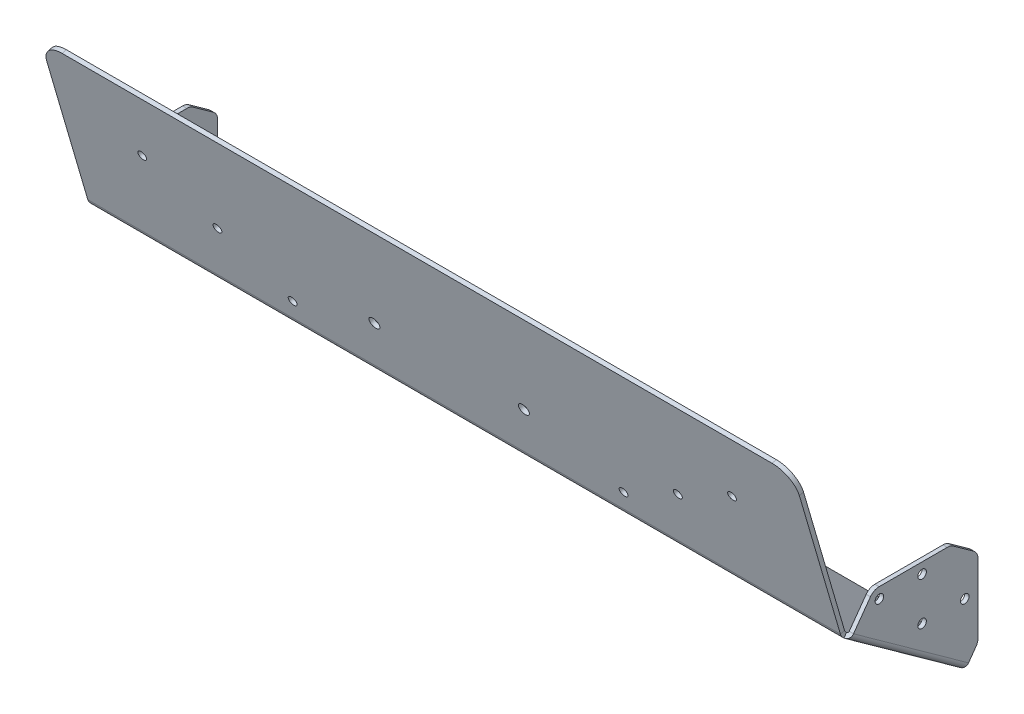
ISO-10303-21;
HEADER;
FILE_DESCRIPTION(('STEP AP214'),'2;1');
FILE_NAME('part.step','',(''),(''),'','','');
FILE_SCHEMA(('AUTOMOTIVE_DESIGN { 1 0 10303 214 1 1 1 1 }'));
ENDSEC;
DATA;
#1=APPLICATION_CONTEXT('core data for automotive mechanical design processes');
#2=APPLICATION_PROTOCOL_DEFINITION('international standard','automotive_design',2000,#1);
#3=PRODUCT_CONTEXT('',#1,'mechanical');
#4=PRODUCT('Part','Part','',(#3));
#5=PRODUCT_RELATED_PRODUCT_CATEGORY('part','',(#4));
#6=PRODUCT_DEFINITION_FORMATION('','',#4);
#7=PRODUCT_DEFINITION_CONTEXT('part definition',#1,'design');
#8=PRODUCT_DEFINITION('design','',#6,#7);
#9=PRODUCT_DEFINITION_SHAPE('','',#8);
#10=(LENGTH_UNIT() NAMED_UNIT(*) SI_UNIT(.MILLI.,.METRE.));
#11=(NAMED_UNIT(*) PLANE_ANGLE_UNIT() SI_UNIT($,.RADIAN.));
#12=(NAMED_UNIT(*) SI_UNIT($,.STERADIAN.) SOLID_ANGLE_UNIT());
#13=UNCERTAINTY_MEASURE_WITH_UNIT(LENGTH_MEASURE(1.E-05),#10,'distance_accuracy_value','');
#14=(GEOMETRIC_REPRESENTATION_CONTEXT(3) GLOBAL_UNCERTAINTY_ASSIGNED_CONTEXT((#13)) GLOBAL_UNIT_ASSIGNED_CONTEXT((#10,
#11,#12)) REPRESENTATION_CONTEXT('',''));
#15=CARTESIAN_POINT('',(0.,0.,0.));
#16=DIRECTION('',(0.,0.,1.));
#17=DIRECTION('',(1.,0.,0.));
#18=AXIS2_PLACEMENT_3D('',#15,#16,#17);
#19=CARTESIAN_POINT('',(223.8375,-149.205630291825,101.175402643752));
#20=DIRECTION('',(0.,-0.583734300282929,-0.811944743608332));
#21=DIRECTION('',(0.707106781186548,-0.574131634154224,0.412762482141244));
#22=AXIS2_PLACEMENT_3D('',#19,#20,#21);
#23=CYLINDRICAL_SURFACE('',#22,1.016);
#24=CARTESIAN_POINT('',(223.8375,-124.606552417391,135.391469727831));
#25=DIRECTION('',(0.,-0.583734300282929,-0.811944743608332));
#26=DIRECTION('',(0.,0.811944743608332,-0.583734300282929));
#27=AXIS2_PLACEMENT_3D('',#24,#25,#26);
#28=CIRCLE('',#27,1.016);
#29=CARTESIAN_POINT('',(224.8535,-124.606552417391,135.391469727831));
#30=VERTEX_POINT('',#29);
#31=CARTESIAN_POINT('',(223.8375,-125.431488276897,135.984543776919));
#32=VERTEX_POINT('',#31);
#33=EDGE_CURVE('E20',#30,#32,#28,.T.);
#34=ORIENTED_EDGE('',*,*,#33,.F.);
#35=DIRECTION('',(0.,0.58373430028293,0.811944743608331));
#36=VECTOR('',#35,1.);
#37=CARTESIAN_POINT('',(224.8535,-149.205630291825,101.175402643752));
#38=LINE('',#37,#36);
#39=CARTESIAN_POINT('',(224.8535,-173.80470816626,66.9593355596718));
#40=VERTEX_POINT('',#39);
#41=EDGE_CURVE('E854',#40,#30,#38,.T.);
#42=ORIENTED_EDGE('',*,*,#41,.F.);
#43=CARTESIAN_POINT('',(223.8375,-173.80470816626,66.9593355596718));
#44=DIRECTION('',(0.,-0.583734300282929,-0.811944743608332));
#45=DIRECTION('',(0.,0.811944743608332,-0.583734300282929));
#46=AXIS2_PLACEMENT_3D('',#43,#44,#45);
#47=CIRCLE('',#46,1.016);
#48=CARTESIAN_POINT('',(223.8375,-174.629644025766,67.5524096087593));
#49=VERTEX_POINT('',#48);
#50=EDGE_CURVE('E881',#40,#49,#47,.T.);
#51=ORIENTED_EDGE('',*,*,#50,.T.);
#52=DIRECTION('',(0.,0.58373430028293,0.811944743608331));
#53=VECTOR('',#52,1.);
#54=CARTESIAN_POINT('',(223.8375,-153.103993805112,97.4934950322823));
#55=LINE('',#54,#53);
#56=EDGE_CURVE('E915',#49,#32,#55,.T.);
#57=ORIENTED_EDGE('',*,*,#56,.T.);
#58=EDGE_LOOP('',(#34,#42,#51,#57));
#59=FACE_BOUND('',#58,.T.);
#60=ADVANCED_FACE('F17',(#59),#23,.F.);
#61=CARTESIAN_POINT('',(223.8375,-149.205630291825,101.175402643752));
#62=DIRECTION('',(0.,-0.583734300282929,-0.811944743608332));
#63=DIRECTION('',(0.707106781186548,-0.574131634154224,0.412762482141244));
#64=AXIS2_PLACEMENT_3D('',#61,#62,#63);
#65=CYLINDRICAL_SURFACE('',#64,3.556);
#66=CARTESIAN_POINT('',(223.8375,-124.606552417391,135.391469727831));
#67=DIRECTION('',(0.,-0.583734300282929,-0.811944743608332));
#68=DIRECTION('',(0.,0.811944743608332,-0.583734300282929));
#69=AXIS2_PLACEMENT_3D('',#66,#67,#68);
#70=CIRCLE('',#69,3.556);
#71=CARTESIAN_POINT('',(227.3935,-124.606552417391,135.391469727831));
#72=VERTEX_POINT('',#71);
#73=CARTESIAN_POINT('',(223.8375,-127.493827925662,137.467228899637));
#74=VERTEX_POINT('',#73);
#75=EDGE_CURVE('E11',#72,#74,#70,.T.);
#76=ORIENTED_EDGE('',*,*,#75,.T.);
#77=DIRECTION('',(0.,0.58373430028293,0.811944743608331));
#78=VECTOR('',#77,1.);
#79=CARTESIAN_POINT('',(223.8375,-155.166333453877,98.9761801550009));
#80=LINE('',#79,#78);
#81=CARTESIAN_POINT('',(223.8375,-176.691983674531,69.0350947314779));
#82=VERTEX_POINT('',#81);
#83=EDGE_CURVE('E1001',#82,#74,#80,.T.);
#84=ORIENTED_EDGE('',*,*,#83,.F.);
#85=CARTESIAN_POINT('',(223.8375,-173.80470816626,66.9593355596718));
#86=DIRECTION('',(0.,-0.583734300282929,-0.811944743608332));
#87=DIRECTION('',(0.,0.811944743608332,-0.583734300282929));
#88=AXIS2_PLACEMENT_3D('',#85,#86,#87);
#89=CIRCLE('',#88,3.556);
#90=CARTESIAN_POINT('',(227.3935,-173.80470816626,66.9593355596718));
#91=VERTEX_POINT('',#90);
#92=EDGE_CURVE('E883',#91,#82,#89,.T.);
#93=ORIENTED_EDGE('',*,*,#92,.F.);
#94=DIRECTION('',(0.,0.58373430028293,0.811944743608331));
#95=VECTOR('',#94,1.);
#96=CARTESIAN_POINT('',(227.3935,-149.205630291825,101.175402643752));
#97=LINE('',#96,#95);
#98=EDGE_CURVE('E871',#91,#72,#97,.T.);
#99=ORIENTED_EDGE('',*,*,#98,.T.);
#100=EDGE_LOOP('',(#76,#84,#93,#99));
#101=FACE_BOUND('',#100,.T.);
#102=ADVANCED_FACE('F1225',(#101),#65,.T.);
#103=CARTESIAN_POINT('',(223.8375,-124.606552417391,135.391469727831));
#104=DIRECTION('',(0.,0.583734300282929,0.811944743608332));
#105=DIRECTION('',(1.,0.,0.));
#106=AXIS2_PLACEMENT_3D('',#103,#104,#105);
#107=PLANE('',#106);
#108=DIRECTION('',(-1.,0.,0.));
#109=VECTOR('',#108,1.);
#110=CARTESIAN_POINT('',(227.3935,-124.606552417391,135.391469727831));
#111=LINE('',#110,#109);
#112=EDGE_CURVE('E789',#72,#30,#111,.T.);
#113=ORIENTED_EDGE('',*,*,#112,.T.);
#114=ORIENTED_EDGE('',*,*,#33,.T.);
#115=DIRECTION('',(0.,0.811944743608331,-0.58373430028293));
#116=VECTOR('',#115,1.);
#117=CARTESIAN_POINT('',(223.8375,-127.493827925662,137.467228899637));
#118=LINE('',#117,#116);
#119=EDGE_CURVE('E634',#74,#32,#118,.T.);
#120=ORIENTED_EDGE('',*,*,#119,.F.);
#121=ORIENTED_EDGE('',*,*,#75,.F.);
#122=EDGE_LOOP('',(#113,#114,#120,#121));
#123=FACE_BOUND('',#122,.T.);
#124=ADVANCED_FACE('F897',(#123),#107,.T.);
#125=CARTESIAN_POINT('',(223.8375,-173.80470816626,66.9593355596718));
#126=DIRECTION('',(0.,0.583734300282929,0.811944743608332));
#127=DIRECTION('',(1.,0.,0.));
#128=AXIS2_PLACEMENT_3D('',#125,#126,#127);
#129=PLANE('',#128);
#130=DIRECTION('',(0.,0.811944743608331,-0.58373430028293));
#131=VECTOR('',#130,1.);
#132=CARTESIAN_POINT('',(223.8375,-176.691983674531,69.0350947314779));
#133=LINE('',#132,#131);
#134=EDGE_CURVE('E1042',#82,#49,#133,.T.);
#135=ORIENTED_EDGE('',*,*,#134,.T.);
#136=ORIENTED_EDGE('',*,*,#50,.F.);
#137=DIRECTION('',(-1.,0.,0.));
#138=VECTOR('',#137,1.);
#139=CARTESIAN_POINT('',(227.3935,-173.80470816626,66.9593355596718));
#140=LINE('',#139,#138);
#141=EDGE_CURVE('E771',#91,#40,#140,.T.);
#142=ORIENTED_EDGE('',*,*,#141,.F.);
#143=ORIENTED_EDGE('',*,*,#92,.T.);
#144=EDGE_LOOP('',(#135,#136,#142,#143));
#145=FACE_BOUND('',#144,.T.);
#146=ADVANCED_FACE('F1236',(#145),#129,.F.);
#147=CARTESIAN_POINT('',(227.3935,-114.3,79.6715147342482));
#148=DIRECTION('',(-1.,0.,0.));
#149=DIRECTION('',(0.,0.,1.));
#150=AXIS2_PLACEMENT_3D('',#147,#148,#149);
#151=CYLINDRICAL_SURFACE('',#150,6.35);
#152=CARTESIAN_POINT('',(227.3935,-114.3,79.6715147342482));
#153=DIRECTION('',(1.,0.,0.));
#154=DIRECTION('',(0.,0.,1.));
#155=AXIS2_PLACEMENT_3D('',#152,#153,#154);
#156=CIRCLE('',#155,6.35);
#157=CARTESIAN_POINT('',(227.3935,-109.144150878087,75.9648019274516));
#158=VERTEX_POINT('',#157);
#159=CARTESIAN_POINT('',(227.3935,-107.95,79.6715147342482));
#160=VERTEX_POINT('',#159);
#161=EDGE_CURVE('E878',#158,#160,#156,.T.);
#162=ORIENTED_EDGE('',*,*,#161,.F.);
#163=DIRECTION('',(1.,0.,0.));
#164=VECTOR('',#163,1.);
#165=CARTESIAN_POINT('',(227.3935,-109.144150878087,75.9648019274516));
#166=LINE('',#165,#164);
#167=CARTESIAN_POINT('',(224.8535,-109.144150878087,75.9648019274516));
#168=VERTEX_POINT('',#167);
#169=EDGE_CURVE('E821',#168,#158,#166,.T.);
#170=ORIENTED_EDGE('',*,*,#169,.F.);
#171=CARTESIAN_POINT('',(224.8535,-114.3,79.6715147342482));
#172=DIRECTION('',(-1.,0.,0.));
#173=DIRECTION('',(0.,0.,1.));
#174=AXIS2_PLACEMENT_3D('',#171,#172,#173);
#175=CIRCLE('',#174,6.35);
#176=CARTESIAN_POINT('',(224.8535,-107.95,79.6715147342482));
#177=VERTEX_POINT('',#176);
#178=EDGE_CURVE('E780',#177,#168,#175,.T.);
#179=ORIENTED_EDGE('',*,*,#178,.F.);
#180=DIRECTION('',(-1.,0.,0.));
#181=VECTOR('',#180,1.);
#182=CARTESIAN_POINT('',(227.3935,-107.95,79.6715147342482));
#183=LINE('',#182,#181);
#184=EDGE_CURVE('E805',#160,#177,#183,.T.);
#185=ORIENTED_EDGE('',*,*,#184,.F.);
#186=EDGE_LOOP('',(#162,#170,#179,#185));
#187=FACE_BOUND('',#186,.T.);
#188=ADVANCED_FACE('F1299',(#187),#151,.T.);
#189=CARTESIAN_POINT('',(227.3935,-163.944179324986,67.6910000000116));
#190=DIRECTION('',(1.,0.,0.));
#191=DIRECTION('',(0.,0.,-1.));
#192=AXIS2_PLACEMENT_3D('',#189,#190,#191);
#193=CYLINDRICAL_SURFACE('',#192,6.35);
#194=CARTESIAN_POINT('',(227.3935,-163.944179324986,67.6910000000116));
#195=DIRECTION('',(1.,0.,0.));
#196=DIRECTION('',(0.,0.,1.));
#197=AXIS2_PLACEMENT_3D('',#194,#195,#196);
#198=CIRCLE('',#197,6.35);
#199=CARTESIAN_POINT('',(227.3935,-167.650892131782,62.5351508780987));
#200=VERTEX_POINT('',#199);
#201=CARTESIAN_POINT('',(227.3935,-163.944179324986,61.3410000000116));
#202=VERTEX_POINT('',#201);
#203=EDGE_CURVE('E872',#200,#202,#198,.T.);
#204=ORIENTED_EDGE('',*,*,#203,.F.);
#205=DIRECTION('',(1.,0.,0.));
#206=VECTOR('',#205,1.);
#207=CARTESIAN_POINT('',(227.3935,-167.650892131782,62.5351508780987));
#208=LINE('',#207,#206);
#209=CARTESIAN_POINT('',(224.8535,-167.650892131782,62.5351508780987));
#210=VERTEX_POINT('',#209);
#211=EDGE_CURVE('E763',#210,#200,#208,.T.);
#212=ORIENTED_EDGE('',*,*,#211,.F.);
#213=CARTESIAN_POINT('',(224.8535,-163.944179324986,67.6910000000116));
#214=DIRECTION('',(-1.,0.,0.));
#215=DIRECTION('',(0.,0.,1.));
#216=AXIS2_PLACEMENT_3D('',#213,#214,#215);
#217=CIRCLE('',#216,6.35);
#218=CARTESIAN_POINT('',(224.8535,-163.944179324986,61.3410000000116));
#219=VERTEX_POINT('',#218);
#220=EDGE_CURVE('E851',#219,#210,#217,.T.);
#221=ORIENTED_EDGE('',*,*,#220,.F.);
#222=DIRECTION('',(-1.,0.,0.));
#223=VECTOR('',#222,1.);
#224=CARTESIAN_POINT('',(227.3935,-163.944179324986,61.3410000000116));
#225=LINE('',#224,#223);
#226=EDGE_CURVE('E834',#202,#219,#225,.T.);
#227=ORIENTED_EDGE('',*,*,#226,.F.);
#228=EDGE_LOOP('',(#204,#212,#221,#227));
#229=FACE_BOUND('',#228,.T.);
#230=ADVANCED_FACE('F1246',(#229),#193,.T.);
#231=CARTESIAN_POINT('',(227.3935,-122.913193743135,67.6910000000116));
#232=DIRECTION('',(1.,0.,0.));
#233=DIRECTION('',(0.,0.,-1.));
#234=AXIS2_PLACEMENT_3D('',#231,#232,#233);
#235=CYLINDRICAL_SURFACE('',#234,6.35);
#236=CARTESIAN_POINT('',(227.3935,-122.913193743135,67.6910000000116));
#237=DIRECTION('',(1.,0.,0.));
#238=DIRECTION('',(0.,0.,1.));
#239=AXIS2_PLACEMENT_3D('',#236,#237,#238);
#240=CIRCLE('',#239,6.35);
#241=CARTESIAN_POINT('',(227.3935,-122.913193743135,61.3410000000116));
#242=VERTEX_POINT('',#241);
#243=CARTESIAN_POINT('',(227.3935,-117.757344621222,63.984287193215));
#244=VERTEX_POINT('',#243);
#245=EDGE_CURVE('E875',#242,#244,#240,.T.);
#246=ORIENTED_EDGE('',*,*,#245,.F.);
#247=DIRECTION('',(1.,0.,0.));
#248=VECTOR('',#247,1.);
#249=CARTESIAN_POINT('',(227.3935,-122.913193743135,61.3410000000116));
#250=LINE('',#249,#248);
#251=CARTESIAN_POINT('',(224.8535,-122.913193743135,61.3410000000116));
#252=VERTEX_POINT('',#251);
#253=EDGE_CURVE('E826',#252,#242,#250,.T.);
#254=ORIENTED_EDGE('',*,*,#253,.F.);
#255=CARTESIAN_POINT('',(224.8535,-122.913193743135,67.6910000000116));
#256=DIRECTION('',(-1.,0.,0.));
#257=DIRECTION('',(0.,0.,1.));
#258=AXIS2_PLACEMENT_3D('',#255,#256,#257);
#259=CIRCLE('',#258,6.35);
#260=CARTESIAN_POINT('',(224.8535,-117.757344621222,63.984287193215));
#261=VERTEX_POINT('',#260);
#262=EDGE_CURVE('E783',#261,#252,#259,.T.);
#263=ORIENTED_EDGE('',*,*,#262,.F.);
#264=DIRECTION('',(-1.,0.,0.));
#265=VECTOR('',#264,1.);
#266=CARTESIAN_POINT('',(227.3935,-117.757344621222,63.984287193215));
#267=LINE('',#266,#265);
#268=EDGE_CURVE('E813',#244,#261,#267,.T.);
#269=ORIENTED_EDGE('',*,*,#268,.F.);
#270=EDGE_LOOP('',(#246,#254,#263,#269));
#271=FACE_BOUND('',#270,.T.);
#272=ADVANCED_FACE('F1242',(#271),#235,.T.);
#273=CARTESIAN_POINT('',(227.3935,-114.3,120.161014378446));
#274=DIRECTION('',(-1.,0.,0.));
#275=DIRECTION('',(0.,0.,1.));
#276=AXIS2_PLACEMENT_3D('',#273,#274,#275);
#277=CYLINDRICAL_SURFACE('',#276,6.35);
#278=CARTESIAN_POINT('',(227.3935,-114.3,120.161014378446));
#279=DIRECTION('',(1.,0.,0.));
#280=DIRECTION('',(0.,0.,1.));
#281=AXIS2_PLACEMENT_3D('',#278,#279,#280);
#282=CIRCLE('',#281,6.35);
#283=CARTESIAN_POINT('',(227.3935,-107.95,120.161014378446));
#284=VERTEX_POINT('',#283);
#285=CARTESIAN_POINT('',(227.3935,-110.593287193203,125.316863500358));
#286=VERTEX_POINT('',#285);
#287=EDGE_CURVE('E868',#284,#286,#282,.T.);
#288=ORIENTED_EDGE('',*,*,#287,.F.);
#289=DIRECTION('',(1.,0.,0.));
#290=VECTOR('',#289,1.);
#291=CARTESIAN_POINT('',(227.3935,-107.95,120.161014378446));
#292=LINE('',#291,#290);
#293=CARTESIAN_POINT('',(224.8535,-107.95,120.161014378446));
#294=VERTEX_POINT('',#293);
#295=EDGE_CURVE('E797',#294,#284,#292,.T.);
#296=ORIENTED_EDGE('',*,*,#295,.F.);
#297=CARTESIAN_POINT('',(224.8535,-114.3,120.161014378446));
#298=DIRECTION('',(-1.,0.,0.));
#299=DIRECTION('',(0.,0.,1.));
#300=AXIS2_PLACEMENT_3D('',#297,#298,#299);
#301=CIRCLE('',#300,6.35);
#302=CARTESIAN_POINT('',(224.8535,-110.593287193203,125.316863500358));
#303=VERTEX_POINT('',#302);
#304=EDGE_CURVE('E784',#303,#294,#301,.T.);
#305=ORIENTED_EDGE('',*,*,#304,.F.);
#306=DIRECTION('',(-1.,0.,0.));
#307=VECTOR('',#306,1.);
#308=CARTESIAN_POINT('',(227.3935,-110.593287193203,125.316863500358));
#309=LINE('',#308,#307);
#310=EDGE_CURVE('E779',#286,#303,#309,.T.);
#311=ORIENTED_EDGE('',*,*,#310,.F.);
#312=EDGE_LOOP('',(#288,#296,#305,#311));
#313=FACE_BOUND('',#312,.T.);
#314=ADVANCED_FACE('F1245',(#313),#277,.T.);
#315=CARTESIAN_POINT('',(227.3935,-114.3,120.015000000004));
#316=DIRECTION('',(-1.,0.,0.));
#317=DIRECTION('',(0.,0.,1.));
#318=AXIS2_PLACEMENT_3D('',#315,#316,#317);
#319=CYLINDRICAL_SURFACE('',#318,2.5527);
#320=CARTESIAN_POINT('',(227.3935,-114.3,120.015000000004));
#321=DIRECTION('',(-1.,0.,0.));
#322=DIRECTION('',(0.,0.,1.));
#323=AXIS2_PLACEMENT_3D('',#320,#321,#322);
#324=CIRCLE('',#323,2.5527);
#325=CARTESIAN_POINT('',(227.3935,-114.3,122.567700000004));
#326=VERTEX_POINT('',#325);
#327=EDGE_CURVE('E128',#326,#326,#324,.T.);
#328=ORIENTED_EDGE('',*,*,#327,.F.);
#329=EDGE_LOOP('',(#328));
#330=FACE_BOUND('',#329,.T.);
#331=CARTESIAN_POINT('',(224.8535,-114.3,120.015000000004));
#332=DIRECTION('',(1.,0.,0.));
#333=DIRECTION('',(0.,0.,1.));
#334=AXIS2_PLACEMENT_3D('',#331,#332,#333);
#335=CIRCLE('',#334,2.5527);
#336=CARTESIAN_POINT('',(224.8535,-114.3,122.567700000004));
#337=VERTEX_POINT('',#336);
#338=EDGE_CURVE('E838',#337,#337,#335,.T.);
#339=ORIENTED_EDGE('',*,*,#338,.F.);
#340=EDGE_LOOP('',(#339));
#341=FACE_BOUND('',#340,.T.);
#342=ADVANCED_FACE('F1840',(#330,#341),#319,.F.);
#343=CARTESIAN_POINT('',(227.3935,-114.3,94.6150000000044));
#344=DIRECTION('',(-1.,0.,0.));
#345=DIRECTION('',(0.,0.,1.));
#346=AXIS2_PLACEMENT_3D('',#343,#344,#345);
#347=CYLINDRICAL_SURFACE('',#346,2.5527);
#348=CARTESIAN_POINT('',(227.3935,-114.3,94.6150000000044));
#349=DIRECTION('',(-1.,0.,0.));
#350=DIRECTION('',(0.,0.,1.));
#351=AXIS2_PLACEMENT_3D('',#348,#349,#350);
#352=CIRCLE('',#351,2.5527);
#353=CARTESIAN_POINT('',(227.3935,-114.3,97.1677000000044));
#354=VERTEX_POINT('',#353);
#355=EDGE_CURVE('E860',#354,#354,#352,.T.);
#356=ORIENTED_EDGE('',*,*,#355,.F.);
#357=EDGE_LOOP('',(#356));
#358=FACE_BOUND('',#357,.T.);
#359=CARTESIAN_POINT('',(224.8535,-114.3,94.6150000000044));
#360=DIRECTION('',(1.,0.,0.));
#361=DIRECTION('',(0.,0.,1.));
#362=AXIS2_PLACEMENT_3D('',#359,#360,#361);
#363=CIRCLE('',#362,2.5527);
#364=CARTESIAN_POINT('',(224.8535,-114.3,97.1677000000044));
#365=VERTEX_POINT('',#364);
#366=EDGE_CURVE('E841',#365,#365,#363,.T.);
#367=ORIENTED_EDGE('',*,*,#366,.F.);
#368=EDGE_LOOP('',(#367));
#369=FACE_BOUND('',#368,.T.);
#370=ADVANCED_FACE('F1251',(#358,#369),#347,.F.);
#371=CARTESIAN_POINT('',(227.3935,-139.7,94.6150000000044));
#372=DIRECTION('',(-1.,0.,0.));
#373=DIRECTION('',(0.,0.,1.));
#374=AXIS2_PLACEMENT_3D('',#371,#372,#373);
#375=CYLINDRICAL_SURFACE('',#374,2.5527);
#376=CARTESIAN_POINT('',(227.3935,-139.7,94.6150000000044));
#377=DIRECTION('',(-1.,0.,0.));
#378=DIRECTION('',(0.,0.,1.));
#379=AXIS2_PLACEMENT_3D('',#376,#377,#378);
#380=CIRCLE('',#379,2.5527);
#381=CARTESIAN_POINT('',(227.3935,-139.7,97.1677000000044));
#382=VERTEX_POINT('',#381);
#383=EDGE_CURVE('E863',#382,#382,#380,.T.);
#384=ORIENTED_EDGE('',*,*,#383,.F.);
#385=EDGE_LOOP('',(#384));
#386=FACE_BOUND('',#385,.T.);
#387=CARTESIAN_POINT('',(224.8535,-139.7,94.6150000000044));
#388=DIRECTION('',(1.,0.,0.));
#389=DIRECTION('',(0.,0.,1.));
#390=AXIS2_PLACEMENT_3D('',#387,#388,#389);
#391=CIRCLE('',#390,2.5527);
#392=CARTESIAN_POINT('',(224.8535,-139.7,97.1677000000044));
#393=VERTEX_POINT('',#392);
#394=EDGE_CURVE('E844',#393,#393,#391,.T.);
#395=ORIENTED_EDGE('',*,*,#394,.F.);
#396=EDGE_LOOP('',(#395));
#397=FACE_BOUND('',#396,.T.);
#398=ADVANCED_FACE('F1248',(#386,#397),#375,.F.);
#399=CARTESIAN_POINT('',(227.3935,-139.7,69.2150000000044));
#400=DIRECTION('',(-1.,0.,0.));
#401=DIRECTION('',(0.,0.,1.));
#402=AXIS2_PLACEMENT_3D('',#399,#400,#401);
#403=CYLINDRICAL_SURFACE('',#402,2.5527);
#404=CARTESIAN_POINT('',(227.3935,-139.7,69.2150000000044));
#405=DIRECTION('',(-1.,0.,0.));
#406=DIRECTION('',(0.,0.,1.));
#407=AXIS2_PLACEMENT_3D('',#404,#405,#406);
#408=CIRCLE('',#407,2.5527);
#409=CARTESIAN_POINT('',(227.3935,-139.7,71.7677000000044));
#410=VERTEX_POINT('',#409);
#411=EDGE_CURVE('E37',#410,#410,#408,.T.);
#412=ORIENTED_EDGE('',*,*,#411,.F.);
#413=EDGE_LOOP('',(#412));
#414=FACE_BOUND('',#413,.T.);
#415=CARTESIAN_POINT('',(224.8535,-139.7,69.2150000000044));
#416=DIRECTION('',(1.,0.,0.));
#417=DIRECTION('',(0.,0.,1.));
#418=AXIS2_PLACEMENT_3D('',#415,#416,#417);
#419=CIRCLE('',#418,2.5527);
#420=CARTESIAN_POINT('',(224.8535,-139.7,71.7677000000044));
#421=VERTEX_POINT('',#420);
#422=EDGE_CURVE('E140',#421,#421,#419,.T.);
#423=ORIENTED_EDGE('',*,*,#422,.F.);
#424=EDGE_LOOP('',(#423));
#425=FACE_BOUND('',#424,.T.);
#426=ADVANCED_FACE('F1250',(#414,#425),#403,.F.);
#427=CARTESIAN_POINT('',(227.3935,-131.469509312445,88.4243105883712));
#428=DIRECTION('',(-1.,0.,0.));
#429=DIRECTION('',(0.,0.,1.));
#430=AXIS2_PLACEMENT_3D('',#427,#428,#429);
#431=PLANE('',#430);
#432=DIRECTION('',(0.,0.,1.));
#433=VECTOR('',#432,1.);
#434=CARTESIAN_POINT('',(227.3935,-107.95,88.4243105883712));
#435=LINE('',#434,#433);
#436=EDGE_CURVE('E801',#160,#284,#435,.T.);
#437=ORIENTED_EDGE('',*,*,#436,.T.);
#438=ORIENTED_EDGE('',*,*,#287,.T.);
#439=DIRECTION('',(0.,-0.811944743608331,0.58373430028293));
#440=VECTOR('',#439,1.);
#441=CARTESIAN_POINT('',(227.3935,-106.870431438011,122.640377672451));
#442=LINE('',#441,#440);
#443=EDGE_CURVE('E775',#286,#72,#442,.T.);
#444=ORIENTED_EDGE('',*,*,#443,.T.);
#445=ORIENTED_EDGE('',*,*,#98,.F.);
#446=DIRECTION('',(0.,0.811944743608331,-0.58373430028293));
#447=VECTOR('',#446,1.);
#448=CARTESIAN_POINT('',(227.3935,-156.068587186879,54.2082435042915));
#449=LINE('',#448,#447);
#450=EDGE_CURVE('E767',#91,#200,#449,.T.);
#451=ORIENTED_EDGE('',*,*,#450,.T.);
#452=ORIENTED_EDGE('',*,*,#203,.T.);
#453=DIRECTION('',(0.,-1.,0.));
#454=VECTOR('',#453,1.);
#455=CARTESIAN_POINT('',(227.3935,-131.469509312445,61.3410000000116));
#456=LINE('',#455,#454);
#457=EDGE_CURVE('E830',#242,#202,#456,.T.);
#458=ORIENTED_EDGE('',*,*,#457,.F.);
#459=ORIENTED_EDGE('',*,*,#245,.T.);
#460=DIRECTION('',(0.,0.583734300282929,0.811944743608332));
#461=VECTOR('',#460,1.);
#462=CARTESIAN_POINT('',(227.3935,-110.846112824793,73.5974593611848));
#463=LINE('',#462,#461);
#464=EDGE_CURVE('E809',#244,#158,#463,.T.);
#465=ORIENTED_EDGE('',*,*,#464,.T.);
#466=ORIENTED_EDGE('',*,*,#161,.T.);
#467=EDGE_LOOP('',(#437,#438,#444,#445,#451,#452,#458,#459,#465,#466));
#468=FACE_BOUND('',#467,.T.);
#469=ORIENTED_EDGE('',*,*,#411,.T.);
#470=EDGE_LOOP('',(#469));
#471=FACE_BOUND('',#470,.T.);
#472=ORIENTED_EDGE('',*,*,#383,.T.);
#473=EDGE_LOOP('',(#472));
#474=FACE_BOUND('',#473,.T.);
#475=ORIENTED_EDGE('',*,*,#355,.T.);
#476=EDGE_LOOP('',(#475));
#477=FACE_BOUND('',#476,.T.);
#478=ORIENTED_EDGE('',*,*,#327,.T.);
#479=EDGE_LOOP('',(#478));
#480=FACE_BOUND('',#479,.T.);
#481=ADVANCED_FACE('F1813',(#468,#471,#474,#477,#480),#431,.F.);
#482=CARTESIAN_POINT('',(224.8535,-131.469509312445,88.4243105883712));
#483=DIRECTION('',(-1.,0.,0.));
#484=DIRECTION('',(0.,0.,1.));
#485=AXIS2_PLACEMENT_3D('',#482,#483,#484);
#486=PLANE('',#485);
#487=DIRECTION('',(0.,-0.811944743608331,0.58373430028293));
#488=VECTOR('',#487,1.);
#489=CARTESIAN_POINT('',(224.8535,-106.870431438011,122.640377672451));
#490=LINE('',#489,#488);
#491=EDGE_CURVE('E785',#303,#30,#490,.T.);
#492=ORIENTED_EDGE('',*,*,#491,.F.);
#493=ORIENTED_EDGE('',*,*,#304,.T.);
#494=DIRECTION('',(0.,0.,1.));
#495=VECTOR('',#494,1.);
#496=CARTESIAN_POINT('',(224.8535,-107.95,88.4243105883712));
#497=LINE('',#496,#495);
#498=EDGE_CURVE('E793',#177,#294,#497,.T.);
#499=ORIENTED_EDGE('',*,*,#498,.F.);
#500=ORIENTED_EDGE('',*,*,#178,.T.);
#501=DIRECTION('',(0.,0.583734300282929,0.811944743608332));
#502=VECTOR('',#501,1.);
#503=CARTESIAN_POINT('',(224.8535,-110.846112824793,73.5974593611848));
#504=LINE('',#503,#502);
#505=EDGE_CURVE('E817',#261,#168,#504,.T.);
#506=ORIENTED_EDGE('',*,*,#505,.F.);
#507=ORIENTED_EDGE('',*,*,#262,.T.);
#508=DIRECTION('',(0.,-1.,0.));
#509=VECTOR('',#508,1.);
#510=CARTESIAN_POINT('',(224.8535,-131.469509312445,61.3410000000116));
#511=LINE('',#510,#509);
#512=EDGE_CURVE('E822',#252,#219,#511,.T.);
#513=ORIENTED_EDGE('',*,*,#512,.T.);
#514=ORIENTED_EDGE('',*,*,#220,.T.);
#515=DIRECTION('',(0.,0.811944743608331,-0.58373430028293));
#516=VECTOR('',#515,1.);
#517=CARTESIAN_POINT('',(224.8535,-156.068587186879,54.2082435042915));
#518=LINE('',#517,#516);
#519=EDGE_CURVE('E759',#40,#210,#518,.T.);
#520=ORIENTED_EDGE('',*,*,#519,.F.);
#521=ORIENTED_EDGE('',*,*,#41,.T.);
#522=EDGE_LOOP('',(#492,#493,#499,#500,#506,#507,#513,#514,#520,#521));
#523=FACE_BOUND('',#522,.T.);
#524=ORIENTED_EDGE('',*,*,#422,.T.);
#525=EDGE_LOOP('',(#524));
#526=FACE_BOUND('',#525,.T.);
#527=ORIENTED_EDGE('',*,*,#394,.T.);
#528=EDGE_LOOP('',(#527));
#529=FACE_BOUND('',#528,.T.);
#530=ORIENTED_EDGE('',*,*,#366,.T.);
#531=EDGE_LOOP('',(#530));
#532=FACE_BOUND('',#531,.T.);
#533=ORIENTED_EDGE('',*,*,#338,.T.);
#534=EDGE_LOOP('',(#533));
#535=FACE_BOUND('',#534,.T.);
#536=ADVANCED_FACE('F1803',(#523,#526,#529,#532,#535),#486,.T.);
#537=CARTESIAN_POINT('',(227.3935,-131.469509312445,61.3410000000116));
#538=DIRECTION('',(0.,0.,-1.));
#539=DIRECTION('',(0.,-1.,0.));
#540=AXIS2_PLACEMENT_3D('',#537,#538,#539);
#541=PLANE('',#540);
#542=ORIENTED_EDGE('',*,*,#512,.F.);
#543=ORIENTED_EDGE('',*,*,#253,.T.);
#544=ORIENTED_EDGE('',*,*,#457,.T.);
#545=ORIENTED_EDGE('',*,*,#226,.T.);
#546=EDGE_LOOP('',(#542,#543,#544,#545));
#547=FACE_BOUND('',#546,.T.);
#548=ADVANCED_FACE('F1307',(#547),#541,.T.);
#549=CARTESIAN_POINT('',(227.3935,-110.846112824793,73.5974593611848));
#550=DIRECTION('',(0.,-0.811944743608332,0.583734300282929));
#551=DIRECTION('',(-1.,0.,0.));
#552=AXIS2_PLACEMENT_3D('',#549,#550,#551);
#553=PLANE('',#552);
#554=ORIENTED_EDGE('',*,*,#464,.F.);
#555=ORIENTED_EDGE('',*,*,#268,.T.);
#556=ORIENTED_EDGE('',*,*,#505,.T.);
#557=ORIENTED_EDGE('',*,*,#169,.T.);
#558=EDGE_LOOP('',(#554,#555,#556,#557));
#559=FACE_BOUND('',#558,.T.);
#560=ADVANCED_FACE('F1303',(#559),#553,.F.);
#561=CARTESIAN_POINT('',(227.3935,-107.95,88.4243105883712));
#562=DIRECTION('',(0.,-1.,0.));
#563=DIRECTION('',(-1.,0.,0.));
#564=AXIS2_PLACEMENT_3D('',#561,#562,#563);
#565=PLANE('',#564);
#566=ORIENTED_EDGE('',*,*,#498,.T.);
#567=ORIENTED_EDGE('',*,*,#295,.T.);
#568=ORIENTED_EDGE('',*,*,#436,.F.);
#569=ORIENTED_EDGE('',*,*,#184,.T.);
#570=EDGE_LOOP('',(#566,#567,#568,#569));
#571=FACE_BOUND('',#570,.T.);
#572=ADVANCED_FACE('F1306',(#571),#565,.F.);
#573=CARTESIAN_POINT('',(227.3935,-106.870431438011,122.640377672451));
#574=DIRECTION('',(0.,-0.58373430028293,-0.811944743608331));
#575=DIRECTION('',(0.,-0.811944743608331,0.58373430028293));
#576=AXIS2_PLACEMENT_3D('',#573,#574,#575);
#577=PLANE('',#576);
#578=ORIENTED_EDGE('',*,*,#443,.F.);
#579=ORIENTED_EDGE('',*,*,#310,.T.);
#580=ORIENTED_EDGE('',*,*,#491,.T.);
#581=ORIENTED_EDGE('',*,*,#112,.F.);
#582=EDGE_LOOP('',(#578,#579,#580,#581));
#583=FACE_BOUND('',#582,.T.);
#584=ADVANCED_FACE('F1266',(#583),#577,.F.);
#585=CARTESIAN_POINT('',(227.3935,-156.068587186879,54.2082435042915));
#586=DIRECTION('',(0.,0.58373430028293,0.811944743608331));
#587=DIRECTION('',(1.,0.,0.));
#588=AXIS2_PLACEMENT_3D('',#585,#586,#587);
#589=PLANE('',#588);
#590=ORIENTED_EDGE('',*,*,#519,.T.);
#591=ORIENTED_EDGE('',*,*,#211,.T.);
#592=ORIENTED_EDGE('',*,*,#450,.F.);
#593=ORIENTED_EDGE('',*,*,#141,.T.);
#594=EDGE_LOOP('',(#590,#591,#592,#593));
#595=FACE_BOUND('',#594,.T.);
#596=ADVANCED_FACE('F1262',(#595),#589,.F.);
#597=CARTESIAN_POINT('',(-223.8375,-149.205630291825,101.175402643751));
#598=DIRECTION('',(0.,0.58373430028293,0.811944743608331));
#599=DIRECTION('',(-0.707106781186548,-0.574131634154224,0.412762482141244));
#600=AXIS2_PLACEMENT_3D('',#597,#598,#599);
#601=CYLINDRICAL_SURFACE('',#600,1.016);
#602=CARTESIAN_POINT('',(-223.8375,-173.80470816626,66.9593355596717));
#603=DIRECTION('',(0.,0.58373430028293,0.811944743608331));
#604=DIRECTION('',(0.,-0.811944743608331,0.58373430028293));
#605=AXIS2_PLACEMENT_3D('',#602,#603,#604);
#606=CIRCLE('',#605,1.016);
#607=CARTESIAN_POINT('',(-224.8535,-173.80470816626,66.9593355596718));
#608=VERTEX_POINT('',#607);
#609=CARTESIAN_POINT('',(-223.8375,-174.629644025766,67.5524096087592));
#610=VERTEX_POINT('',#609);
#611=EDGE_CURVE('E753',#608,#610,#606,.T.);
#612=ORIENTED_EDGE('',*,*,#611,.F.);
#613=DIRECTION('',(0.,0.58373430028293,0.811944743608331));
#614=VECTOR('',#613,1.);
#615=CARTESIAN_POINT('',(-224.8535,-152.279057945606,96.9004209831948));
#616=LINE('',#615,#614);
#617=CARTESIAN_POINT('',(-224.8535,-124.606552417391,135.391469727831));
#618=VERTEX_POINT('',#617);
#619=EDGE_CURVE('E721',#608,#618,#616,.T.);
#620=ORIENTED_EDGE('',*,*,#619,.T.);
#621=CARTESIAN_POINT('',(-223.8375,-124.606552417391,135.391469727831));
#622=DIRECTION('',(0.,0.58373430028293,0.811944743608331));
#623=DIRECTION('',(0.,-0.811944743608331,0.58373430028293));
#624=AXIS2_PLACEMENT_3D('',#621,#622,#623);
#625=CIRCLE('',#624,1.016);
#626=CARTESIAN_POINT('',(-223.8375,-125.431488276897,135.984543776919));
#627=VERTEX_POINT('',#626);
#628=EDGE_CURVE('E633',#618,#627,#625,.T.);
#629=ORIENTED_EDGE('',*,*,#628,.T.);
#630=DIRECTION('',(0.,0.58373430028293,0.811944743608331));
#631=VECTOR('',#630,1.);
#632=CARTESIAN_POINT('',(-223.8375,-153.103993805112,97.4934950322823));
#633=LINE('',#632,#631);
#634=EDGE_CURVE('E926',#610,#627,#633,.T.);
#635=ORIENTED_EDGE('',*,*,#634,.F.);
#636=EDGE_LOOP('',(#612,#620,#629,#635));
#637=FACE_BOUND('',#636,.T.);
#638=ADVANCED_FACE('F1265',(#637),#601,.F.);
#639=CARTESIAN_POINT('',(-223.8375,-149.205630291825,101.175402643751));
#640=DIRECTION('',(0.,0.58373430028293,0.811944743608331));
#641=DIRECTION('',(-0.707106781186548,-0.574131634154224,0.412762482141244));
#642=AXIS2_PLACEMENT_3D('',#639,#640,#641);
#643=CYLINDRICAL_SURFACE('',#642,3.556);
#644=CARTESIAN_POINT('',(-223.8375,-173.80470816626,66.9593355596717));
#645=DIRECTION('',(0.,0.58373430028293,0.811944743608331));
#646=DIRECTION('',(0.,-0.811944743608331,0.58373430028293));
#647=AXIS2_PLACEMENT_3D('',#644,#645,#646);
#648=CIRCLE('',#647,3.556);
#649=CARTESIAN_POINT('',(-227.3935,-173.80470816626,66.9593355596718));
#650=VERTEX_POINT('',#649);
#651=CARTESIAN_POINT('',(-223.8375,-176.691983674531,69.0350947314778));
#652=VERTEX_POINT('',#651);
#653=EDGE_CURVE('E756',#650,#652,#648,.T.);
#654=ORIENTED_EDGE('',*,*,#653,.T.);
#655=DIRECTION('',(0.,0.58373430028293,0.811944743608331));
#656=VECTOR('',#655,1.);
#657=CARTESIAN_POINT('',(-223.8375,-155.166333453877,98.9761801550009));
#658=LINE('',#657,#656);
#659=CARTESIAN_POINT('',(-223.8375,-127.493827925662,137.467228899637));
#660=VERTEX_POINT('',#659);
#661=EDGE_CURVE('E551',#652,#660,#658,.T.);
#662=ORIENTED_EDGE('',*,*,#661,.T.);
#663=CARTESIAN_POINT('',(-223.8375,-124.606552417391,135.391469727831));
#664=DIRECTION('',(0.,0.58373430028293,0.811944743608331));
#665=DIRECTION('',(0.,-0.811944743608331,0.58373430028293));
#666=AXIS2_PLACEMENT_3D('',#663,#664,#665);
#667=CIRCLE('',#666,3.556);
#668=CARTESIAN_POINT('',(-227.3935,-124.606552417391,135.391469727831));
#669=VERTEX_POINT('',#668);
#670=EDGE_CURVE('E750',#669,#660,#667,.T.);
#671=ORIENTED_EDGE('',*,*,#670,.F.);
#672=DIRECTION('',(0.,0.58373430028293,0.811944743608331));
#673=VECTOR('',#672,1.);
#674=CARTESIAN_POINT('',(-227.3935,-152.279057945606,96.9004209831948));
#675=LINE('',#674,#673);
#676=EDGE_CURVE('E620',#650,#669,#675,.T.);
#677=ORIENTED_EDGE('',*,*,#676,.F.);
#678=EDGE_LOOP('',(#654,#662,#671,#677));
#679=FACE_BOUND('',#678,.T.);
#680=ADVANCED_FACE('F1761',(#679),#643,.T.);
#681=CARTESIAN_POINT('',(-223.8375,-173.80470816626,66.9593355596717));
#682=DIRECTION('',(0.,-0.58373430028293,-0.811944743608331));
#683=DIRECTION('',(0.,-0.811944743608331,0.58373430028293));
#684=AXIS2_PLACEMENT_3D('',#681,#682,#683);
#685=PLANE('',#684);
#686=DIRECTION('',(1.,0.,0.));
#687=VECTOR('',#686,1.);
#688=CARTESIAN_POINT('',(-227.3935,-173.80470816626,66.9593355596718));
#689=LINE('',#688,#687);
#690=EDGE_CURVE('E559',#650,#608,#689,.T.);
#691=ORIENTED_EDGE('',*,*,#690,.T.);
#692=ORIENTED_EDGE('',*,*,#611,.T.);
#693=DIRECTION('',(0.,0.811944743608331,-0.58373430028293));
#694=VECTOR('',#693,1.);
#695=CARTESIAN_POINT('',(-223.8375,-176.691983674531,69.0350947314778));
#696=LINE('',#695,#694);
#697=EDGE_CURVE('E1134',#652,#610,#696,.T.);
#698=ORIENTED_EDGE('',*,*,#697,.F.);
#699=ORIENTED_EDGE('',*,*,#653,.F.);
#700=EDGE_LOOP('',(#691,#692,#698,#699));
#701=FACE_BOUND('',#700,.T.);
#702=ADVANCED_FACE('F1752',(#701),#685,.T.);
#703=CARTESIAN_POINT('',(-223.8375,-124.606552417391,135.391469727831));
#704=DIRECTION('',(0.,-0.58373430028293,-0.811944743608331));
#705=DIRECTION('',(0.,-0.811944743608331,0.58373430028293));
#706=AXIS2_PLACEMENT_3D('',#703,#704,#705);
#707=PLANE('',#706);
#708=DIRECTION('',(0.,0.811944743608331,-0.58373430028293));
#709=VECTOR('',#708,1.);
#710=CARTESIAN_POINT('',(-223.8375,-127.493827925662,137.467228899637));
#711=LINE('',#710,#709);
#712=EDGE_CURVE('E605',#660,#627,#711,.T.);
#713=ORIENTED_EDGE('',*,*,#712,.T.);
#714=ORIENTED_EDGE('',*,*,#628,.F.);
#715=DIRECTION('',(1.,0.,0.));
#716=VECTOR('',#715,1.);
#717=CARTESIAN_POINT('',(-227.3935,-124.606552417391,135.391469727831));
#718=LINE('',#717,#716);
#719=EDGE_CURVE('E729',#669,#618,#718,.T.);
#720=ORIENTED_EDGE('',*,*,#719,.F.);
#721=ORIENTED_EDGE('',*,*,#670,.T.);
#722=EDGE_LOOP('',(#713,#714,#720,#721));
#723=FACE_BOUND('',#722,.T.);
#724=ADVANCED_FACE('F1742',(#723),#707,.F.);
#725=CARTESIAN_POINT('',(-227.3935,-163.944179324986,67.6910000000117));
#726=DIRECTION('',(-1.,0.,0.));
#727=DIRECTION('',(0.,0.,1.));
#728=AXIS2_PLACEMENT_3D('',#725,#726,#727);
#729=CYLINDRICAL_SURFACE('',#728,6.35);
#730=CARTESIAN_POINT('',(-227.3935,-163.944179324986,67.6910000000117));
#731=DIRECTION('',(-1.,0.,0.));
#732=DIRECTION('',(0.,0.,-1.));
#733=AXIS2_PLACEMENT_3D('',#730,#731,#732);
#734=CIRCLE('',#733,6.35);
#735=CARTESIAN_POINT('',(-227.3935,-163.944179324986,61.3410000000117));
#736=VERTEX_POINT('',#735);
#737=CARTESIAN_POINT('',(-227.3935,-167.650892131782,62.5351508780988));
#738=VERTEX_POINT('',#737);
#739=EDGE_CURVE('E617',#736,#738,#734,.T.);
#740=ORIENTED_EDGE('',*,*,#739,.F.);
#741=DIRECTION('',(-1.,0.,0.));
#742=VECTOR('',#741,1.);
#743=CARTESIAN_POINT('',(-227.3935,-163.944179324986,61.3410000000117));
#744=LINE('',#743,#742);
#745=CARTESIAN_POINT('',(-224.8535,-163.944179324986,61.3410000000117));
#746=VERTEX_POINT('',#745);
#747=EDGE_CURVE('E1069',#746,#736,#744,.T.);
#748=ORIENTED_EDGE('',*,*,#747,.F.);
#749=CARTESIAN_POINT('',(-224.8535,-163.944179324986,67.6910000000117));
#750=DIRECTION('',(1.,0.,0.));
#751=DIRECTION('',(0.,0.,-1.));
#752=AXIS2_PLACEMENT_3D('',#749,#750,#751);
#753=CIRCLE('',#752,6.35);
#754=CARTESIAN_POINT('',(-224.8535,-167.650892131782,62.5351508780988));
#755=VERTEX_POINT('',#754);
#756=EDGE_CURVE('E724',#755,#746,#753,.T.);
#757=ORIENTED_EDGE('',*,*,#756,.F.);
#758=DIRECTION('',(1.,0.,0.));
#759=VECTOR('',#758,1.);
#760=CARTESIAN_POINT('',(-227.3935,-167.650892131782,62.5351508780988));
#761=LINE('',#760,#759);
#762=EDGE_CURVE('E560',#738,#755,#761,.T.);
#763=ORIENTED_EDGE('',*,*,#762,.F.);
#764=EDGE_LOOP('',(#740,#748,#757,#763));
#765=FACE_BOUND('',#764,.T.);
#766=ADVANCED_FACE('F1732',(#765),#729,.T.);
#767=CARTESIAN_POINT('',(-227.3935,-122.913193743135,67.6910000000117));
#768=DIRECTION('',(-1.,0.,0.));
#769=DIRECTION('',(0.,0.,1.));
#770=AXIS2_PLACEMENT_3D('',#767,#768,#769);
#771=CYLINDRICAL_SURFACE('',#770,6.35);
#772=CARTESIAN_POINT('',(-227.3935,-122.913193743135,67.6910000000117));
#773=DIRECTION('',(-1.,0.,0.));
#774=DIRECTION('',(0.,0.,-1.));
#775=AXIS2_PLACEMENT_3D('',#772,#773,#774);
#776=CIRCLE('',#775,6.35);
#777=CARTESIAN_POINT('',(-227.3935,-117.757344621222,63.9842871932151));
#778=VERTEX_POINT('',#777);
#779=CARTESIAN_POINT('',(-227.3935,-122.913193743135,61.3410000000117));
#780=VERTEX_POINT('',#779);
#781=EDGE_CURVE('E621',#778,#780,#776,.T.);
#782=ORIENTED_EDGE('',*,*,#781,.F.);
#783=DIRECTION('',(-1.,0.,0.));
#784=VECTOR('',#783,1.);
#785=CARTESIAN_POINT('',(-227.3935,-117.757344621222,63.9842871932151));
#786=LINE('',#785,#784);
#787=CARTESIAN_POINT('',(-224.8535,-117.757344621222,63.9842871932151));
#788=VERTEX_POINT('',#787);
#789=EDGE_CURVE('E684',#788,#778,#786,.T.);
#790=ORIENTED_EDGE('',*,*,#789,.F.);
#791=CARTESIAN_POINT('',(-224.8535,-122.913193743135,67.6910000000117));
#792=DIRECTION('',(1.,0.,0.));
#793=DIRECTION('',(0.,0.,-1.));
#794=AXIS2_PLACEMENT_3D('',#791,#792,#793);
#795=CIRCLE('',#794,6.35);
#796=CARTESIAN_POINT('',(-224.8535,-122.913193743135,61.3410000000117));
#797=VERTEX_POINT('',#796);
#798=EDGE_CURVE('E737',#797,#788,#795,.T.);
#799=ORIENTED_EDGE('',*,*,#798,.F.);
#800=DIRECTION('',(1.,0.,0.));
#801=VECTOR('',#800,1.);
#802=CARTESIAN_POINT('',(-227.3935,-122.913193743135,61.3410000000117));
#803=LINE('',#802,#801);
#804=EDGE_CURVE('E654',#780,#797,#803,.T.);
#805=ORIENTED_EDGE('',*,*,#804,.F.);
#806=EDGE_LOOP('',(#782,#790,#799,#805));
#807=FACE_BOUND('',#806,.T.);
#808=ADVANCED_FACE('F1723',(#807),#771,.T.);
#809=CARTESIAN_POINT('',(-227.3935,-114.3,79.6715147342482));
#810=DIRECTION('',(1.,0.,0.));
#811=DIRECTION('',(0.,0.,-1.));
#812=AXIS2_PLACEMENT_3D('',#809,#810,#811);
#813=CYLINDRICAL_SURFACE('',#812,6.35);
#814=CARTESIAN_POINT('',(-227.3935,-114.3,79.6715147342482));
#815=DIRECTION('',(-1.,0.,0.));
#816=DIRECTION('',(0.,0.,-1.));
#817=AXIS2_PLACEMENT_3D('',#814,#815,#816);
#818=CIRCLE('',#817,6.35);
#819=CARTESIAN_POINT('',(-227.3935,-107.95,79.6715147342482));
#820=VERTEX_POINT('',#819);
#821=CARTESIAN_POINT('',(-227.3935,-109.144150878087,75.9648019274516));
#822=VERTEX_POINT('',#821);
#823=EDGE_CURVE('E691',#820,#822,#818,.T.);
#824=ORIENTED_EDGE('',*,*,#823,.F.);
#825=DIRECTION('',(-1.,0.,0.));
#826=VECTOR('',#825,1.);
#827=CARTESIAN_POINT('',(-227.3935,-107.95,79.6715147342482));
#828=LINE('',#827,#826);
#829=CARTESIAN_POINT('',(-224.8535,-107.95,79.6715147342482));
#830=VERTEX_POINT('',#829);
#831=EDGE_CURVE('E615',#830,#820,#828,.T.);
#832=ORIENTED_EDGE('',*,*,#831,.F.);
#833=CARTESIAN_POINT('',(-224.8535,-114.3,79.6715147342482));
#834=DIRECTION('',(1.,0.,0.));
#835=DIRECTION('',(0.,0.,-1.));
#836=AXIS2_PLACEMENT_3D('',#833,#834,#835);
#837=CIRCLE('',#836,6.35);
#838=CARTESIAN_POINT('',(-224.8535,-109.144150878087,75.9648019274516));
#839=VERTEX_POINT('',#838);
#840=EDGE_CURVE('E740',#839,#830,#837,.T.);
#841=ORIENTED_EDGE('',*,*,#840,.F.);
#842=DIRECTION('',(1.,0.,0.));
#843=VECTOR('',#842,1.);
#844=CARTESIAN_POINT('',(-227.3935,-109.144150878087,75.9648019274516));
#845=LINE('',#844,#843);
#846=EDGE_CURVE('E704',#822,#839,#845,.T.);
#847=ORIENTED_EDGE('',*,*,#846,.F.);
#848=EDGE_LOOP('',(#824,#832,#841,#847));
#849=FACE_BOUND('',#848,.T.);
#850=ADVANCED_FACE('F1712',(#849),#813,.T.);
#851=CARTESIAN_POINT('',(-227.3935,-114.3,120.161014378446));
#852=DIRECTION('',(1.,0.,0.));
#853=DIRECTION('',(0.,0.,-1.));
#854=AXIS2_PLACEMENT_3D('',#851,#852,#853);
#855=CYLINDRICAL_SURFACE('',#854,6.35);
#856=CARTESIAN_POINT('',(-227.3935,-114.3,120.161014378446));
#857=DIRECTION('',(-1.,0.,0.));
#858=DIRECTION('',(0.,0.,-1.));
#859=AXIS2_PLACEMENT_3D('',#856,#857,#858);
#860=CIRCLE('',#859,6.35);
#861=CARTESIAN_POINT('',(-227.3935,-110.593287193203,125.316863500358));
#862=VERTEX_POINT('',#861);
#863=CARTESIAN_POINT('',(-227.3935,-107.95,120.161014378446));
#864=VERTEX_POINT('',#863);
#865=EDGE_CURVE('E688',#862,#864,#860,.T.);
#866=ORIENTED_EDGE('',*,*,#865,.F.);
#867=DIRECTION('',(-1.,0.,0.));
#868=VECTOR('',#867,1.);
#869=CARTESIAN_POINT('',(-227.3935,-110.593287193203,125.316863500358));
#870=LINE('',#869,#868);
#871=CARTESIAN_POINT('',(-224.8535,-110.593287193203,125.316863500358));
#872=VERTEX_POINT('',#871);
#873=EDGE_CURVE('E716',#872,#862,#870,.T.);
#874=ORIENTED_EDGE('',*,*,#873,.F.);
#875=CARTESIAN_POINT('',(-224.8535,-114.3,120.161014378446));
#876=DIRECTION('',(1.,0.,0.));
#877=DIRECTION('',(0.,0.,-1.));
#878=AXIS2_PLACEMENT_3D('',#875,#876,#877);
#879=CIRCLE('',#878,6.35);
#880=CARTESIAN_POINT('',(-224.8535,-107.95,120.161014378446));
#881=VERTEX_POINT('',#880);
#882=EDGE_CURVE('E542',#881,#872,#879,.T.);
#883=ORIENTED_EDGE('',*,*,#882,.F.);
#884=DIRECTION('',(1.,0.,0.));
#885=VECTOR('',#884,1.);
#886=CARTESIAN_POINT('',(-227.3935,-107.95,120.161014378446));
#887=LINE('',#886,#885);
#888=EDGE_CURVE('E616',#864,#881,#887,.T.);
#889=ORIENTED_EDGE('',*,*,#888,.F.);
#890=EDGE_LOOP('',(#866,#874,#883,#889));
#891=FACE_BOUND('',#890,.T.);
#892=ADVANCED_FACE('F1701',(#891),#855,.T.);
#893=CARTESIAN_POINT('',(227.3935,-114.3,120.015000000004));
#894=DIRECTION('',(-1.,0.,0.));
#895=DIRECTION('',(0.,0.,1.));
#896=AXIS2_PLACEMENT_3D('',#893,#894,#895);
#897=CYLINDRICAL_SURFACE('',#896,2.5527);
#898=CARTESIAN_POINT('',(-227.3935,-114.3,120.015000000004));
#899=DIRECTION('',(-1.,0.,0.));
#900=DIRECTION('',(0.,0.,-1.));
#901=AXIS2_PLACEMENT_3D('',#898,#899,#900);
#902=CIRCLE('',#901,2.5527);
#903=CARTESIAN_POINT('',(-227.3935,-114.3,117.462300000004));
#904=VERTEX_POINT('',#903);
#905=EDGE_CURVE('E741',#904,#904,#902,.T.);
#906=ORIENTED_EDGE('',*,*,#905,.T.);
#907=EDGE_LOOP('',(#906));
#908=FACE_BOUND('',#907,.T.);
#909=CARTESIAN_POINT('',(-224.8535,-114.3,120.015000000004));
#910=DIRECTION('',(-1.,0.,0.));
#911=DIRECTION('',(0.,0.,-1.));
#912=AXIS2_PLACEMENT_3D('',#909,#910,#911);
#913=CIRCLE('',#912,2.5527);
#914=CARTESIAN_POINT('',(-224.8535,-114.3,117.462300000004));
#915=VERTEX_POINT('',#914);
#916=EDGE_CURVE('E545',#915,#915,#913,.T.);
#917=ORIENTED_EDGE('',*,*,#916,.F.);
#918=EDGE_LOOP('',(#917));
#919=FACE_BOUND('',#918,.T.);
#920=ADVANCED_FACE('F1691',(#908,#919),#897,.F.);
#921=CARTESIAN_POINT('',(227.3935,-114.3,94.6150000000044));
#922=DIRECTION('',(-1.,0.,0.));
#923=DIRECTION('',(0.,0.,1.));
#924=AXIS2_PLACEMENT_3D('',#921,#922,#923);
#925=CYLINDRICAL_SURFACE('',#924,2.5527);
#926=CARTESIAN_POINT('',(-227.3935,-114.3,94.6150000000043));
#927=DIRECTION('',(-1.,0.,0.));
#928=DIRECTION('',(0.,0.,-1.));
#929=AXIS2_PLACEMENT_3D('',#926,#927,#928);
#930=CIRCLE('',#929,2.5527);
#931=CARTESIAN_POINT('',(-227.3935,-114.3,92.0623000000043));
#932=VERTEX_POINT('',#931);
#933=EDGE_CURVE('E744',#932,#932,#930,.T.);
#934=ORIENTED_EDGE('',*,*,#933,.T.);
#935=EDGE_LOOP('',(#934));
#936=FACE_BOUND('',#935,.T.);
#937=CARTESIAN_POINT('',(-224.8535,-114.3,94.6150000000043));
#938=DIRECTION('',(-1.,0.,0.));
#939=DIRECTION('',(0.,0.,-1.));
#940=AXIS2_PLACEMENT_3D('',#937,#938,#939);
#941=CIRCLE('',#940,2.5527);
#942=CARTESIAN_POINT('',(-224.8535,-114.3,92.0623000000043));
#943=VERTEX_POINT('',#942);
#944=EDGE_CURVE('E527',#943,#943,#941,.T.);
#945=ORIENTED_EDGE('',*,*,#944,.F.);
#946=EDGE_LOOP('',(#945));
#947=FACE_BOUND('',#946,.T.);
#948=ADVANCED_FACE('F1681',(#936,#947),#925,.F.);
#949=CARTESIAN_POINT('',(227.3935,-139.7,94.6150000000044));
#950=DIRECTION('',(-1.,0.,0.));
#951=DIRECTION('',(0.,0.,1.));
#952=AXIS2_PLACEMENT_3D('',#949,#950,#951);
#953=CYLINDRICAL_SURFACE('',#952,2.5527);
#954=CARTESIAN_POINT('',(-227.3935,-139.7,94.6150000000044));
#955=DIRECTION('',(-1.,0.,0.));
#956=DIRECTION('',(0.,0.,-1.));
#957=AXIS2_PLACEMENT_3D('',#954,#955,#956);
#958=CIRCLE('',#957,2.5527);
#959=CARTESIAN_POINT('',(-227.3935,-139.7,92.0623000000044));
#960=VERTEX_POINT('',#959);
#961=EDGE_CURVE('E747',#960,#960,#958,.T.);
#962=ORIENTED_EDGE('',*,*,#961,.T.);
#963=EDGE_LOOP('',(#962));
#964=FACE_BOUND('',#963,.T.);
#965=CARTESIAN_POINT('',(-224.8535,-139.7,94.6150000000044));
#966=DIRECTION('',(-1.,0.,0.));
#967=DIRECTION('',(0.,0.,-1.));
#968=AXIS2_PLACEMENT_3D('',#965,#966,#967);
#969=CIRCLE('',#968,2.5527);
#970=CARTESIAN_POINT('',(-224.8535,-139.7,92.0623000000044));
#971=VERTEX_POINT('',#970);
#972=EDGE_CURVE('E532',#971,#971,#969,.T.);
#973=ORIENTED_EDGE('',*,*,#972,.F.);
#974=EDGE_LOOP('',(#973));
#975=FACE_BOUND('',#974,.T.);
#976=ADVANCED_FACE('F1670',(#964,#975),#953,.F.);
#977=CARTESIAN_POINT('',(227.3935,-139.7,69.2150000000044));
#978=DIRECTION('',(-1.,0.,0.));
#979=DIRECTION('',(0.,0.,1.));
#980=AXIS2_PLACEMENT_3D('',#977,#978,#979);
#981=CYLINDRICAL_SURFACE('',#980,2.5527);
#982=CARTESIAN_POINT('',(-227.3935,-139.7,69.2150000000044));
#983=DIRECTION('',(-1.,0.,0.));
#984=DIRECTION('',(0.,0.,-1.));
#985=AXIS2_PLACEMENT_3D('',#982,#983,#984);
#986=CIRCLE('',#985,2.5527);
#987=CARTESIAN_POINT('',(-227.3935,-139.7,66.6623000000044));
#988=VERTEX_POINT('',#987);
#989=EDGE_CURVE('E692',#988,#988,#986,.T.);
#990=ORIENTED_EDGE('',*,*,#989,.T.);
#991=EDGE_LOOP('',(#990));
#992=FACE_BOUND('',#991,.T.);
#993=CARTESIAN_POINT('',(-224.8535,-139.7,69.2150000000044));
#994=DIRECTION('',(-1.,0.,0.));
#995=DIRECTION('',(0.,0.,-1.));
#996=AXIS2_PLACEMENT_3D('',#993,#994,#995);
#997=CIRCLE('',#996,2.5527);
#998=CARTESIAN_POINT('',(-224.8535,-139.7,66.6623000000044));
#999=VERTEX_POINT('',#998);
#1000=EDGE_CURVE('E536',#999,#999,#997,.T.);
#1001=ORIENTED_EDGE('',*,*,#1000,.F.);
#1002=EDGE_LOOP('',(#1001));
#1003=FACE_BOUND('',#1002,.T.);
#1004=ADVANCED_FACE('F1660',(#992,#1003),#981,.F.);
#1005=CARTESIAN_POINT('',(-227.3935,-131.469509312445,88.4243105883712));
#1006=DIRECTION('',(1.,0.,0.));
#1007=DIRECTION('',(0.,0.,-1.));
#1008=AXIS2_PLACEMENT_3D('',#1005,#1006,#1007);
#1009=PLANE('',#1008);
#1010=DIRECTION('',(0.,0.811944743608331,-0.58373430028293));
#1011=VECTOR('',#1010,1.);
#1012=CARTESIAN_POINT('',(-227.3935,-106.870431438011,122.640377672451));
#1013=LINE('',#1012,#1011);
#1014=EDGE_CURVE('E720',#669,#862,#1013,.T.);
#1015=ORIENTED_EDGE('',*,*,#1014,.T.);
#1016=ORIENTED_EDGE('',*,*,#865,.T.);
#1017=DIRECTION('',(0.,0.,-1.));
#1018=VECTOR('',#1017,1.);
#1019=CARTESIAN_POINT('',(-227.3935,-107.95,88.4243105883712));
#1020=LINE('',#1019,#1018);
#1021=EDGE_CURVE('E680',#864,#820,#1020,.T.);
#1022=ORIENTED_EDGE('',*,*,#1021,.T.);
#1023=ORIENTED_EDGE('',*,*,#823,.T.);
#1024=DIRECTION('',(0.,-0.583734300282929,-0.811944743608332));
#1025=VECTOR('',#1024,1.);
#1026=CARTESIAN_POINT('',(-227.3935,-110.846112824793,73.5974593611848));
#1027=LINE('',#1026,#1025);
#1028=EDGE_CURVE('E700',#822,#778,#1027,.T.);
#1029=ORIENTED_EDGE('',*,*,#1028,.T.);
#1030=ORIENTED_EDGE('',*,*,#781,.T.);
#1031=DIRECTION('',(0.,1.,0.));
#1032=VECTOR('',#1031,1.);
#1033=CARTESIAN_POINT('',(-227.3935,-131.469509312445,61.3410000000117));
#1034=LINE('',#1033,#1032);
#1035=EDGE_CURVE('E659',#736,#780,#1034,.T.);
#1036=ORIENTED_EDGE('',*,*,#1035,.F.);
#1037=ORIENTED_EDGE('',*,*,#739,.T.);
#1038=DIRECTION('',(0.,-0.811944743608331,0.58373430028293));
#1039=VECTOR('',#1038,1.);
#1040=CARTESIAN_POINT('',(-227.3935,-156.068587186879,54.2082435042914));
#1041=LINE('',#1040,#1039);
#1042=EDGE_CURVE('E651',#738,#650,#1041,.T.);
#1043=ORIENTED_EDGE('',*,*,#1042,.T.);
#1044=ORIENTED_EDGE('',*,*,#676,.T.);
#1045=EDGE_LOOP('',(#1015,#1016,#1022,#1023,#1029,#1030,#1036,#1037,#1043,#1044));
#1046=FACE_BOUND('',#1045,.T.);
#1047=ORIENTED_EDGE('',*,*,#989,.F.);
#1048=EDGE_LOOP('',(#1047));
#1049=FACE_BOUND('',#1048,.T.);
#1050=ORIENTED_EDGE('',*,*,#961,.F.);
#1051=EDGE_LOOP('',(#1050));
#1052=FACE_BOUND('',#1051,.T.);
#1053=ORIENTED_EDGE('',*,*,#933,.F.);
#1054=EDGE_LOOP('',(#1053));
#1055=FACE_BOUND('',#1054,.T.);
#1056=ORIENTED_EDGE('',*,*,#905,.F.);
#1057=EDGE_LOOP('',(#1056));
#1058=FACE_BOUND('',#1057,.T.);
#1059=ADVANCED_FACE('F1650',(#1046,#1049,#1052,#1055,#1058),#1009,.F.);
#1060=CARTESIAN_POINT('',(-224.8535,-131.469509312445,88.4243105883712));
#1061=DIRECTION('',(1.,0.,0.));
#1062=DIRECTION('',(0.,0.,-1.));
#1063=AXIS2_PLACEMENT_3D('',#1060,#1061,#1062);
#1064=PLANE('',#1063);
#1065=DIRECTION('',(0.,0.,-1.));
#1066=VECTOR('',#1065,1.);
#1067=CARTESIAN_POINT('',(-224.8535,-107.95,88.4243105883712));
#1068=LINE('',#1067,#1066);
#1069=EDGE_CURVE('E611',#881,#830,#1068,.T.);
#1070=ORIENTED_EDGE('',*,*,#1069,.F.);
#1071=ORIENTED_EDGE('',*,*,#882,.T.);
#1072=DIRECTION('',(0.,0.811944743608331,-0.58373430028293));
#1073=VECTOR('',#1072,1.);
#1074=CARTESIAN_POINT('',(-224.8535,-106.870431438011,122.640377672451));
#1075=LINE('',#1074,#1073);
#1076=EDGE_CURVE('E712',#618,#872,#1075,.T.);
#1077=ORIENTED_EDGE('',*,*,#1076,.F.);
#1078=ORIENTED_EDGE('',*,*,#619,.F.);
#1079=DIRECTION('',(0.,-0.811944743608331,0.58373430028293));
#1080=VECTOR('',#1079,1.);
#1081=CARTESIAN_POINT('',(-224.8535,-156.068587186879,54.2082435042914));
#1082=LINE('',#1081,#1080);
#1083=EDGE_CURVE('E555',#755,#608,#1082,.T.);
#1084=ORIENTED_EDGE('',*,*,#1083,.F.);
#1085=ORIENTED_EDGE('',*,*,#756,.T.);
#1086=DIRECTION('',(0.,1.,0.));
#1087=VECTOR('',#1086,1.);
#1088=CARTESIAN_POINT('',(-224.8535,-131.469509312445,61.3410000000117));
#1089=LINE('',#1088,#1087);
#1090=EDGE_CURVE('E658',#746,#797,#1089,.T.);
#1091=ORIENTED_EDGE('',*,*,#1090,.T.);
#1092=ORIENTED_EDGE('',*,*,#798,.T.);
#1093=DIRECTION('',(0.,-0.583734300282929,-0.811944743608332));
#1094=VECTOR('',#1093,1.);
#1095=CARTESIAN_POINT('',(-224.8535,-110.846112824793,73.5974593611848));
#1096=LINE('',#1095,#1094);
#1097=EDGE_CURVE('E708',#839,#788,#1096,.T.);
#1098=ORIENTED_EDGE('',*,*,#1097,.F.);
#1099=ORIENTED_EDGE('',*,*,#840,.T.);
#1100=EDGE_LOOP('',(#1070,#1071,#1077,#1078,#1084,#1085,#1091,#1092,#1098,#1099));
#1101=FACE_BOUND('',#1100,.T.);
#1102=ORIENTED_EDGE('',*,*,#1000,.T.);
#1103=EDGE_LOOP('',(#1102));
#1104=FACE_BOUND('',#1103,.T.);
#1105=ORIENTED_EDGE('',*,*,#972,.T.);
#1106=EDGE_LOOP('',(#1105));
#1107=FACE_BOUND('',#1106,.T.);
#1108=ORIENTED_EDGE('',*,*,#944,.T.);
#1109=EDGE_LOOP('',(#1108));
#1110=FACE_BOUND('',#1109,.T.);
#1111=ORIENTED_EDGE('',*,*,#916,.T.);
#1112=EDGE_LOOP('',(#1111));
#1113=FACE_BOUND('',#1112,.T.);
#1114=ADVANCED_FACE('F533',(#1101,#1104,#1107,#1110,#1113),#1064,.T.);
#1115=CARTESIAN_POINT('',(-227.3935,-131.469509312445,61.3410000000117));
#1116=DIRECTION('',(0.,0.,-1.));
#1117=DIRECTION('',(-1.,0.,0.));
#1118=AXIS2_PLACEMENT_3D('',#1115,#1116,#1117);
#1119=PLANE('',#1118);
#1120=ORIENTED_EDGE('',*,*,#1035,.T.);
#1121=ORIENTED_EDGE('',*,*,#804,.T.);
#1122=ORIENTED_EDGE('',*,*,#1090,.F.);
#1123=ORIENTED_EDGE('',*,*,#747,.T.);
#1124=EDGE_LOOP('',(#1120,#1121,#1122,#1123));
#1125=FACE_BOUND('',#1124,.T.);
#1126=ADVANCED_FACE('F1631',(#1125),#1119,.T.);
#1127=CARTESIAN_POINT('',(-227.3935,-156.068587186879,54.2082435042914));
#1128=DIRECTION('',(0.,0.58373430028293,0.811944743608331));
#1129=DIRECTION('',(1.,0.,0.));
#1130=AXIS2_PLACEMENT_3D('',#1127,#1128,#1129);
#1131=PLANE('',#1130);
#1132=ORIENTED_EDGE('',*,*,#1042,.F.);
#1133=ORIENTED_EDGE('',*,*,#762,.T.);
#1134=ORIENTED_EDGE('',*,*,#1083,.T.);
#1135=ORIENTED_EDGE('',*,*,#690,.F.);
#1136=EDGE_LOOP('',(#1132,#1133,#1134,#1135));
#1137=FACE_BOUND('',#1136,.T.);
#1138=ADVANCED_FACE('F1622',(#1137),#1131,.F.);
#1139=CARTESIAN_POINT('',(-227.3935,-106.870431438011,122.640377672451));
#1140=DIRECTION('',(0.,-0.58373430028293,-0.811944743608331));
#1141=DIRECTION('',(0.,-0.811944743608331,0.58373430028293));
#1142=AXIS2_PLACEMENT_3D('',#1139,#1140,#1141);
#1143=PLANE('',#1142);
#1144=ORIENTED_EDGE('',*,*,#1076,.T.);
#1145=ORIENTED_EDGE('',*,*,#873,.T.);
#1146=ORIENTED_EDGE('',*,*,#1014,.F.);
#1147=ORIENTED_EDGE('',*,*,#719,.T.);
#1148=EDGE_LOOP('',(#1144,#1145,#1146,#1147));
#1149=FACE_BOUND('',#1148,.T.);
#1150=ADVANCED_FACE('F1612',(#1149),#1143,.F.);
#1151=CARTESIAN_POINT('',(-227.3935,-107.95,88.4243105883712));
#1152=DIRECTION('',(0.,-1.,0.));
#1153=DIRECTION('',(0.,0.,-1.));
#1154=AXIS2_PLACEMENT_3D('',#1151,#1152,#1153);
#1155=PLANE('',#1154);
#1156=ORIENTED_EDGE('',*,*,#1021,.F.);
#1157=ORIENTED_EDGE('',*,*,#888,.T.);
#1158=ORIENTED_EDGE('',*,*,#1069,.T.);
#1159=ORIENTED_EDGE('',*,*,#831,.T.);
#1160=EDGE_LOOP('',(#1156,#1157,#1158,#1159));
#1161=FACE_BOUND('',#1160,.T.);
#1162=ADVANCED_FACE('F1292',(#1161),#1155,.F.);
#1163=CARTESIAN_POINT('',(-227.3935,-110.846112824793,73.5974593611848));
#1164=DIRECTION('',(0.,-0.811944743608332,0.583734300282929));
#1165=DIRECTION('',(-1.,0.,0.));
#1166=AXIS2_PLACEMENT_3D('',#1163,#1164,#1165);
#1167=PLANE('',#1166);
#1168=ORIENTED_EDGE('',*,*,#1028,.F.);
#1169=ORIENTED_EDGE('',*,*,#846,.T.);
#1170=ORIENTED_EDGE('',*,*,#1097,.T.);
#1171=ORIENTED_EDGE('',*,*,#789,.T.);
#1172=EDGE_LOOP('',(#1168,#1169,#1170,#1171));
#1173=FACE_BOUND('',#1172,.T.);
#1174=ADVANCED_FACE('F1289',(#1173),#1167,.F.);
#1175=CARTESIAN_POINT('',(0.,-122.853563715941,134.13118737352));
#1176=DIRECTION('',(1.,0.,0.));
#1177=DIRECTION('',(0.,-0.577663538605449,0.816274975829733));
#1178=AXIS2_PLACEMENT_3D('',#1175,#1176,#1177);
#1179=CYLINDRICAL_SURFACE('',#1178,3.175);
#1180=CARTESIAN_POINT('',(-223.8375,-122.853563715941,134.13118737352));
#1181=DIRECTION('',(1.,0.,0.));
#1182=DIRECTION('',(0.,0.,-1.));
#1183=AXIS2_PLACEMENT_3D('',#1180,#1181,#1182);
#1184=CIRCLE('',#1183,3.175);
#1185=CARTESIAN_POINT('',(-223.8375,-123.743955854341,137.178780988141));
#1186=VERTEX_POINT('',#1185);
#1187=EDGE_CURVE('E601',#1186,#627,#1184,.T.);
#1188=ORIENTED_EDGE('',*,*,#1187,.F.);
#1189=DIRECTION('',(1.,0.,0.));
#1190=VECTOR('',#1189,1.);
#1191=CARTESIAN_POINT('',(-223.8375,-123.743955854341,137.178780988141));
#1192=LINE('',#1191,#1190);
#1193=CARTESIAN_POINT('',(223.8375,-123.743955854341,137.178780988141));
#1194=VERTEX_POINT('',#1193);
#1195=EDGE_CURVE('E583',#1186,#1194,#1192,.T.);
#1196=ORIENTED_EDGE('',*,*,#1195,.T.);
#1197=CARTESIAN_POINT('',(223.8375,-122.853563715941,134.13118737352));
#1198=DIRECTION('',(1.,0.,0.));
#1199=DIRECTION('',(0.,0.,-1.));
#1200=AXIS2_PLACEMENT_3D('',#1197,#1198,#1199);
#1201=CIRCLE('',#1200,3.175);
#1202=EDGE_CURVE('E638',#1194,#32,#1201,.T.);
#1203=ORIENTED_EDGE('',*,*,#1202,.T.);
#1204=DIRECTION('',(1.,0.,0.));
#1205=VECTOR('',#1204,1.);
#1206=CARTESIAN_POINT('',(-223.8375,-125.431488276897,135.984543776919));
#1207=LINE('',#1206,#1205);
#1208=EDGE_CURVE('E907',#627,#32,#1207,.T.);
#1209=ORIENTED_EDGE('',*,*,#1208,.F.);
#1210=EDGE_LOOP('',(#1188,#1196,#1203,#1209));
#1211=FACE_BOUND('',#1210,.T.);
#1212=ADVANCED_FACE('F905',(#1211),#1179,.F.);
#1213=CARTESIAN_POINT('',(0.,-122.853563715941,134.13118737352));
#1214=DIRECTION('',(1.,0.,0.));
#1215=DIRECTION('',(0.,-0.577663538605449,0.816274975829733));
#1216=AXIS2_PLACEMENT_3D('',#1213,#1214,#1215);
#1217=CYLINDRICAL_SURFACE('',#1216,5.715);
#1218=CARTESIAN_POINT('',(-223.8375,-122.853563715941,134.13118737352));
#1219=DIRECTION('',(1.,0.,0.));
#1220=DIRECTION('',(0.,0.,-1.));
#1221=AXIS2_PLACEMENT_3D('',#1218,#1219,#1220);
#1222=CIRCLE('',#1221,5.715);
#1223=CARTESIAN_POINT('',(-223.8375,-124.456269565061,139.616855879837));
#1224=VERTEX_POINT('',#1223);
#1225=EDGE_CURVE('E699',#1224,#660,#1222,.T.);
#1226=ORIENTED_EDGE('',*,*,#1225,.T.);
#1227=DIRECTION('',(1.,0.,0.));
#1228=VECTOR('',#1227,1.);
#1229=CARTESIAN_POINT('',(-223.8375,-127.493827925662,137.467228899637));
#1230=LINE('',#1229,#1228);
#1231=EDGE_CURVE('E549',#660,#74,#1230,.T.);
#1232=ORIENTED_EDGE('',*,*,#1231,.T.);
#1233=CARTESIAN_POINT('',(223.8375,-122.853563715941,134.13118737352));
#1234=DIRECTION('',(1.,0.,0.));
#1235=DIRECTION('',(0.,0.,-1.));
#1236=AXIS2_PLACEMENT_3D('',#1233,#1234,#1235);
#1237=CIRCLE('',#1236,5.715);
#1238=CARTESIAN_POINT('',(223.8375,-124.456269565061,139.616855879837));
#1239=VERTEX_POINT('',#1238);
#1240=EDGE_CURVE('E606',#1239,#74,#1237,.T.);
#1241=ORIENTED_EDGE('',*,*,#1240,.F.);
#1242=DIRECTION('',(1.,0.,0.));
#1243=VECTOR('',#1242,1.);
#1244=CARTESIAN_POINT('',(-223.8375,-124.456269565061,139.616855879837));
#1245=LINE('',#1244,#1243);
#1246=EDGE_CURVE('E639',#1224,#1239,#1245,.T.);
#1247=ORIENTED_EDGE('',*,*,#1246,.F.);
#1248=EDGE_LOOP('',(#1226,#1232,#1241,#1247));
#1249=FACE_BOUND('',#1248,.T.);
#1250=ADVANCED_FACE('F1584',(#1249),#1217,.T.);
#1251=CARTESIAN_POINT('',(-223.8375,-122.853563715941,134.13118737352));
#1252=DIRECTION('',(-1.,0.,0.));
#1253=DIRECTION('',(0.,0.,1.));
#1254=AXIS2_PLACEMENT_3D('',#1251,#1252,#1253);
#1255=PLANE('',#1254);
#1256=DIRECTION('',(0.,0.280438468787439,-0.959872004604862));
#1257=VECTOR('',#1256,1.);
#1258=CARTESIAN_POINT('',(-223.8375,-124.456269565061,139.616855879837));
#1259=LINE('',#1258,#1257);
#1260=EDGE_CURVE('E574',#1224,#1186,#1259,.T.);
#1261=ORIENTED_EDGE('',*,*,#1260,.T.);
#1262=ORIENTED_EDGE('',*,*,#1187,.T.);
#1263=ORIENTED_EDGE('',*,*,#712,.F.);
#1264=ORIENTED_EDGE('',*,*,#1225,.F.);
#1265=EDGE_LOOP('',(#1261,#1262,#1263,#1264));
#1266=FACE_BOUND('',#1265,.T.);
#1267=ADVANCED_FACE('F1576',(#1266),#1255,.T.);
#1268=CARTESIAN_POINT('',(223.8375,-122.853563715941,134.13118737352));
#1269=DIRECTION('',(-1.,0.,0.));
#1270=DIRECTION('',(0.,0.,1.));
#1271=AXIS2_PLACEMENT_3D('',#1268,#1269,#1270);
#1272=PLANE('',#1271);
#1273=ORIENTED_EDGE('',*,*,#119,.T.);
#1274=ORIENTED_EDGE('',*,*,#1202,.F.);
#1275=DIRECTION('',(0.,0.280438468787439,-0.959872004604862));
#1276=VECTOR('',#1275,1.);
#1277=CARTESIAN_POINT('',(223.8375,-124.456269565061,139.616855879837));
#1278=LINE('',#1277,#1276);
#1279=EDGE_CURVE('E625',#1239,#1194,#1278,.T.);
#1280=ORIENTED_EDGE('',*,*,#1279,.F.);
#1281=ORIENTED_EDGE('',*,*,#1240,.T.);
#1282=EDGE_LOOP('',(#1273,#1274,#1280,#1281));
#1283=FACE_BOUND('',#1282,.T.);
#1284=ADVANCED_FACE('F913',(#1283),#1272,.F.);
#1285=CARTESIAN_POINT('',(-211.1375,-41.0125154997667,163.995979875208));
#1286=DIRECTION('',(0.,0.280438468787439,-0.959872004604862));
#1287=DIRECTION('',(0.,0.959872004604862,0.280438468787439));
#1288=AXIS2_PLACEMENT_3D('',#1285,#1286,#1287);
#1289=CYLINDRICAL_SURFACE('',#1288,12.7);
#1290=CARTESIAN_POINT('',(-211.1375,-41.0125154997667,163.995979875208));
#1291=DIRECTION('',(0.,-0.280438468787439,0.959872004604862));
#1292=DIRECTION('',(0.,0.959872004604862,0.280438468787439));
#1293=AXIS2_PLACEMENT_3D('',#1290,#1291,#1292);
#1294=CIRCLE('',#1293,12.7);
#1295=CARTESIAN_POINT('',(-211.1375,-28.822141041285,167.557548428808));
#1296=VERTEX_POINT('',#1295);
#1297=CARTESIAN_POINT('',(-223.8375,-41.0125154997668,163.995979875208));
#1298=VERTEX_POINT('',#1297);
#1299=EDGE_CURVE('E685',#1296,#1298,#1294,.T.);
#1300=ORIENTED_EDGE('',*,*,#1299,.F.);
#1301=DIRECTION('',(0.,-0.280438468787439,0.959872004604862));
#1302=VECTOR('',#1301,1.);
#1303=CARTESIAN_POINT('',(-211.1375,-28.822141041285,167.557548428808));
#1304=LINE('',#1303,#1302);
#1305=CARTESIAN_POINT('',(-211.1375,-28.1098273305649,165.119473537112));
#1306=VERTEX_POINT('',#1305);
#1307=EDGE_CURVE('E592',#1306,#1296,#1304,.T.);
#1308=ORIENTED_EDGE('',*,*,#1307,.F.);
#1309=CARTESIAN_POINT('',(-211.1375,-40.3002017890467,161.557904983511));
#1310=DIRECTION('',(0.,0.280438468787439,-0.959872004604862));
#1311=DIRECTION('',(0.,0.959872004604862,0.280438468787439));
#1312=AXIS2_PLACEMENT_3D('',#1309,#1310,#1311);
#1313=CIRCLE('',#1312,12.7);
#1314=CARTESIAN_POINT('',(-223.8375,-40.3002017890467,161.557904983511));
#1315=VERTEX_POINT('',#1314);
#1316=EDGE_CURVE('E579',#1315,#1306,#1313,.T.);
#1317=ORIENTED_EDGE('',*,*,#1316,.F.);
#1318=DIRECTION('',(0.,0.280438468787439,-0.959872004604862));
#1319=VECTOR('',#1318,1.);
#1320=CARTESIAN_POINT('',(-223.8375,-41.0125154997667,163.995979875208));
#1321=LINE('',#1320,#1319);
#1322=EDGE_CURVE('E564',#1298,#1315,#1321,.T.);
#1323=ORIENTED_EDGE('',*,*,#1322,.F.);
#1324=EDGE_LOOP('',(#1300,#1308,#1317,#1323));
#1325=FACE_BOUND('',#1324,.T.);
#1326=ADVANCED_FACE('F1557',(#1325),#1289,.T.);
#1327=CARTESIAN_POINT('',(211.1375,-41.0125154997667,163.995979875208));
#1328=DIRECTION('',(0.,-0.280438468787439,0.959872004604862));
#1329=DIRECTION('',(0.,-0.959872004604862,-0.280438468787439));
#1330=AXIS2_PLACEMENT_3D('',#1327,#1328,#1329);
#1331=CYLINDRICAL_SURFACE('',#1330,12.7);
#1332=CARTESIAN_POINT('',(211.1375,-41.0125154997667,163.995979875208));
#1333=DIRECTION('',(0.,-0.280438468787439,0.959872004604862));
#1334=DIRECTION('',(0.,0.959872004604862,0.280438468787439));
#1335=AXIS2_PLACEMENT_3D('',#1332,#1333,#1334);
#1336=CIRCLE('',#1335,12.7);
#1337=CARTESIAN_POINT('',(223.8375,-41.0125154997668,163.995979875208));
#1338=VERTEX_POINT('',#1337);
#1339=CARTESIAN_POINT('',(211.1375,-28.822141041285,167.557548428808));
#1340=VERTEX_POINT('',#1339);
#1341=EDGE_CURVE('E678',#1338,#1340,#1336,.T.);
#1342=ORIENTED_EDGE('',*,*,#1341,.F.);
#1343=DIRECTION('',(0.,-0.280438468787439,0.959872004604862));
#1344=VECTOR('',#1343,1.);
#1345=CARTESIAN_POINT('',(223.8375,-41.0125154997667,163.995979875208));
#1346=LINE('',#1345,#1344);
#1347=CARTESIAN_POINT('',(223.8375,-40.3002017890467,161.557904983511));
#1348=VERTEX_POINT('',#1347);
#1349=EDGE_CURVE('E600',#1348,#1338,#1346,.T.);
#1350=ORIENTED_EDGE('',*,*,#1349,.F.);
#1351=CARTESIAN_POINT('',(211.1375,-40.3002017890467,161.557904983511));
#1352=DIRECTION('',(0.,0.280438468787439,-0.959872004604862));
#1353=DIRECTION('',(0.,0.959872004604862,0.280438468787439));
#1354=AXIS2_PLACEMENT_3D('',#1351,#1352,#1353);
#1355=CIRCLE('',#1354,12.7);
#1356=CARTESIAN_POINT('',(211.1375,-28.1098273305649,165.119473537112));
#1357=VERTEX_POINT('',#1356);
#1358=EDGE_CURVE('E572',#1357,#1348,#1355,.T.);
#1359=ORIENTED_EDGE('',*,*,#1358,.F.);
#1360=DIRECTION('',(0.,0.280438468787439,-0.959872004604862));
#1361=VECTOR('',#1360,1.);
#1362=CARTESIAN_POINT('',(211.1375,-28.822141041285,167.557548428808));
#1363=LINE('',#1362,#1361);
#1364=EDGE_CURVE('E584',#1340,#1357,#1363,.T.);
#1365=ORIENTED_EDGE('',*,*,#1364,.F.);
#1366=EDGE_LOOP('',(#1342,#1350,#1359,#1365));
#1367=FACE_BOUND('',#1366,.T.);
#1368=ADVANCED_FACE('F1546',(#1367),#1331,.T.);
#1369=CARTESIAN_POINT('',(136.919829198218,-91.7732699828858,152.288097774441));
#1370=DIRECTION('',(0.,0.280438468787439,-0.959872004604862));
#1371=DIRECTION('',(0.,0.959872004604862,0.280438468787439));
#1372=AXIS2_PLACEMENT_3D('',#1369,#1370,#1371);
#1373=CYLINDRICAL_SURFACE('',#1372,2.5527);
#1374=CARTESIAN_POINT('',(136.919829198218,-90.9327398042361,149.411169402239));
#1375=DIRECTION('',(0.,-0.280438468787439,0.959872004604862));
#1376=DIRECTION('',(0.,0.959872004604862,0.280438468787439));
#1377=AXIS2_PLACEMENT_3D('',#1374,#1375,#1376);
#1378=CIRCLE('',#1377,2.5527);
#1379=CARTESIAN_POINT('',(136.919829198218,-88.4824745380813,150.127044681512));
#1380=VERTEX_POINT('',#1379);
#1381=EDGE_CURVE('E582',#1380,#1380,#1378,.T.);
#1382=ORIENTED_EDGE('',*,*,#1381,.T.);
#1383=EDGE_LOOP('',(#1382));
#1384=FACE_BOUND('',#1383,.T.);
#1385=CARTESIAN_POINT('',(136.919829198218,-90.220426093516,146.973094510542));
#1386=DIRECTION('',(0.,-0.280438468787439,0.959872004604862));
#1387=DIRECTION('',(0.,0.959872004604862,0.280438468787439));
#1388=AXIS2_PLACEMENT_3D('',#1385,#1386,#1387);
#1389=CIRCLE('',#1388,2.5527);
#1390=CARTESIAN_POINT('',(136.919829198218,-87.7701608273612,147.688969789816));
#1391=VERTEX_POINT('',#1390);
#1392=EDGE_CURVE('E629',#1391,#1391,#1389,.T.);
#1393=ORIENTED_EDGE('',*,*,#1392,.F.);
#1394=EDGE_LOOP('',(#1393));
#1395=FACE_BOUND('',#1394,.T.);
#1396=ADVANCED_FACE('F1536',(#1384,#1395),#1373,.F.);
#1397=CARTESIAN_POINT('',(175.414658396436,-70.4401146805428,158.520842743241));
#1398=DIRECTION('',(0.,0.280438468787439,-0.959872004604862));
#1399=DIRECTION('',(0.,0.959872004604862,0.280438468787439));
#1400=AXIS2_PLACEMENT_3D('',#1397,#1398,#1399);
#1401=CYLINDRICAL_SURFACE('',#1400,2.5527);
#1402=CARTESIAN_POINT('',(175.414658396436,-69.599584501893,155.643914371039));
#1403=DIRECTION('',(0.,-0.280438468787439,0.959872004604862));
#1404=DIRECTION('',(0.,0.959872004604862,0.280438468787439));
#1405=AXIS2_PLACEMENT_3D('',#1402,#1403,#1404);
#1406=CIRCLE('',#1405,2.5527);
#1407=CARTESIAN_POINT('',(175.414658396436,-67.1493192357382,156.359789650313));
#1408=VERTEX_POINT('',#1407);
#1409=EDGE_CURVE('E665',#1408,#1408,#1406,.T.);
#1410=ORIENTED_EDGE('',*,*,#1409,.T.);
#1411=EDGE_LOOP('',(#1410));
#1412=FACE_BOUND('',#1411,.T.);
#1413=CARTESIAN_POINT('',(175.414658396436,-68.8872707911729,153.205839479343));
#1414=DIRECTION('',(0.,-0.280438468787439,0.959872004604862));
#1415=DIRECTION('',(0.,0.959872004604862,0.280438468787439));
#1416=AXIS2_PLACEMENT_3D('',#1413,#1414,#1415);
#1417=CIRCLE('',#1416,2.5527);
#1418=CARTESIAN_POINT('',(175.414658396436,-66.4370055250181,153.921714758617));
#1419=VERTEX_POINT('',#1418);
#1420=EDGE_CURVE('E961',#1419,#1419,#1417,.T.);
#1421=ORIENTED_EDGE('',*,*,#1420,.F.);
#1422=EDGE_LOOP('',(#1421));
#1423=FACE_BOUND('',#1422,.T.);
#1424=ADVANCED_FACE('F1526',(#1412,#1423),#1401,.F.);
#1425=CARTESIAN_POINT('',(-98.425,-113.106425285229,146.055352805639));
#1426=DIRECTION('',(0.,0.280438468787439,-0.959872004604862));
#1427=DIRECTION('',(0.,0.959872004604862,0.280438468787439));
#1428=AXIS2_PLACEMENT_3D('',#1425,#1426,#1427);
#1429=CYLINDRICAL_SURFACE('',#1428,2.5527);
#1430=CARTESIAN_POINT('',(-98.425,-112.265895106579,143.178424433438));
#1431=DIRECTION('',(0.,-0.280438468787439,0.959872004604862));
#1432=DIRECTION('',(0.,0.959872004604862,0.280438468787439));
#1433=AXIS2_PLACEMENT_3D('',#1430,#1431,#1432);
#1434=CIRCLE('',#1433,2.5527);
#1435=CARTESIAN_POINT('',(-98.425,-109.815629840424,143.894299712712));
#1436=VERTEX_POINT('',#1435);
#1437=EDGE_CURVE('E668',#1436,#1436,#1434,.T.);
#1438=ORIENTED_EDGE('',*,*,#1437,.T.);
#1439=EDGE_LOOP('',(#1438));
#1440=FACE_BOUND('',#1439,.T.);
#1441=CARTESIAN_POINT('',(-98.425,-111.553581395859,140.740349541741));
#1442=DIRECTION('',(0.,-0.280438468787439,0.959872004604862));
#1443=DIRECTION('',(0.,0.959872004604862,0.280438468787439));
#1444=AXIS2_PLACEMENT_3D('',#1441,#1442,#1443);
#1445=CIRCLE('',#1444,2.5527);
#1446=CARTESIAN_POINT('',(-98.425,-109.103316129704,141.456224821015));
#1447=VERTEX_POINT('',#1446);
#1448=EDGE_CURVE('E644',#1447,#1447,#1445,.T.);
#1449=ORIENTED_EDGE('',*,*,#1448,.F.);
#1450=EDGE_LOOP('',(#1449));
#1451=FACE_BOUND('',#1450,.T.);
#1452=ADVANCED_FACE('F1516',(#1440,#1451),#1429,.F.);
#1453=CARTESIAN_POINT('',(-136.919829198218,-91.7732699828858,152.288097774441));
#1454=DIRECTION('',(0.,0.280438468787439,-0.959872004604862));
#1455=DIRECTION('',(0.,0.959872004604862,0.280438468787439));
#1456=AXIS2_PLACEMENT_3D('',#1453,#1454,#1455);
#1457=CYLINDRICAL_SURFACE('',#1456,2.5527);
#1458=CARTESIAN_POINT('',(-136.919829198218,-90.9327398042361,149.411169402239));
#1459=DIRECTION('',(0.,-0.280438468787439,0.959872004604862));
#1460=DIRECTION('',(0.,0.959872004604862,0.280438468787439));
#1461=AXIS2_PLACEMENT_3D('',#1458,#1459,#1460);
#1462=CIRCLE('',#1461,2.5527);
#1463=CARTESIAN_POINT('',(-136.919829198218,-88.4824745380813,150.127044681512));
#1464=VERTEX_POINT('',#1463);
#1465=EDGE_CURVE('E671',#1464,#1464,#1462,.T.);
#1466=ORIENTED_EDGE('',*,*,#1465,.T.);
#1467=EDGE_LOOP('',(#1466));
#1468=FACE_BOUND('',#1467,.T.);
#1469=CARTESIAN_POINT('',(-136.919829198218,-90.220426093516,146.973094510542));
#1470=DIRECTION('',(0.,-0.280438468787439,0.959872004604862));
#1471=DIRECTION('',(0.,0.959872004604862,0.280438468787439));
#1472=AXIS2_PLACEMENT_3D('',#1469,#1470,#1471);
#1473=CIRCLE('',#1472,2.5527);
#1474=CARTESIAN_POINT('',(-136.919829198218,-87.7701608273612,147.688969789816));
#1475=VERTEX_POINT('',#1474);
#1476=EDGE_CURVE('E640',#1475,#1475,#1473,.T.);
#1477=ORIENTED_EDGE('',*,*,#1476,.F.);
#1478=EDGE_LOOP('',(#1477));
#1479=FACE_BOUND('',#1478,.T.);
#1480=ADVANCED_FACE('F1506',(#1468,#1479),#1457,.F.);
#1481=CARTESIAN_POINT('',(-175.414658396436,-70.4401146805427,158.520842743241));
#1482=DIRECTION('',(0.,0.280438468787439,-0.959872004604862));
#1483=DIRECTION('',(0.,0.959872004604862,0.280438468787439));
#1484=AXIS2_PLACEMENT_3D('',#1481,#1482,#1483);
#1485=CYLINDRICAL_SURFACE('',#1484,2.5527);
#1486=CARTESIAN_POINT('',(-175.414658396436,-69.599584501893,155.643914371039));
#1487=DIRECTION('',(0.,-0.280438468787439,0.959872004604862));
#1488=DIRECTION('',(0.,0.959872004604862,0.280438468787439));
#1489=AXIS2_PLACEMENT_3D('',#1486,#1487,#1488);
#1490=CIRCLE('',#1489,2.5527);
#1491=CARTESIAN_POINT('',(-175.414658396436,-67.1493192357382,156.359789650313));
#1492=VERTEX_POINT('',#1491);
#1493=EDGE_CURVE('E674',#1492,#1492,#1490,.T.);
#1494=ORIENTED_EDGE('',*,*,#1493,.T.);
#1495=EDGE_LOOP('',(#1494));
#1496=FACE_BOUND('',#1495,.T.);
#1497=CARTESIAN_POINT('',(-175.414658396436,-68.8872707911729,153.205839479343));
#1498=DIRECTION('',(0.,-0.280438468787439,0.959872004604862));
#1499=DIRECTION('',(0.,0.959872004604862,0.280438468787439));
#1500=AXIS2_PLACEMENT_3D('',#1497,#1498,#1499);
#1501=CIRCLE('',#1500,2.5527);
#1502=CARTESIAN_POINT('',(-175.414658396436,-66.4370055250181,153.921714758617));
#1503=VERTEX_POINT('',#1502);
#1504=EDGE_CURVE('E643',#1503,#1503,#1501,.T.);
#1505=ORIENTED_EDGE('',*,*,#1504,.F.);
#1506=EDGE_LOOP('',(#1505));
#1507=FACE_BOUND('',#1506,.T.);
#1508=ADVANCED_FACE('F1312',(#1496,#1507),#1485,.F.);
#1509=CARTESIAN_POINT('',(-44.45,-94.8208635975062,151.39770563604));
#1510=DIRECTION('',(0.,0.280438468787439,-0.959872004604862));
#1511=DIRECTION('',(0.,0.959872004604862,0.280438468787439));
#1512=AXIS2_PLACEMENT_3D('',#1509,#1510,#1511);
#1513=CYLINDRICAL_SURFACE('',#1512,3.175);
#1514=CARTESIAN_POINT('',(-44.45,-93.9803334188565,148.520777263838));
#1515=DIRECTION('',(0.,-0.280438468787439,0.959872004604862));
#1516=DIRECTION('',(0.,0.959872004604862,0.280438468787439));
#1517=AXIS2_PLACEMENT_3D('',#1514,#1515,#1516);
#1518=CIRCLE('',#1517,3.175);
#1519=CARTESIAN_POINT('',(-44.45,-90.9327398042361,149.411169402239));
#1520=VERTEX_POINT('',#1519);
#1521=EDGE_CURVE('E974',#1520,#1520,#1518,.T.);
#1522=ORIENTED_EDGE('',*,*,#1521,.T.);
#1523=EDGE_LOOP('',(#1522));
#1524=FACE_BOUND('',#1523,.T.);
#1525=CARTESIAN_POINT('',(-44.45,-93.2680197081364,146.082702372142));
#1526=DIRECTION('',(0.,-0.280438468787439,0.959872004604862));
#1527=DIRECTION('',(0.,0.959872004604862,0.280438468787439));
#1528=AXIS2_PLACEMENT_3D('',#1525,#1526,#1527);
#1529=CIRCLE('',#1528,3.175);
#1530=CARTESIAN_POINT('',(-44.45,-90.220426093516,146.973094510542));
#1531=VERTEX_POINT('',#1530);
#1532=EDGE_CURVE('E647',#1531,#1531,#1529,.T.);
#1533=ORIENTED_EDGE('',*,*,#1532,.F.);
#1534=EDGE_LOOP('',(#1533));
#1535=FACE_BOUND('',#1534,.T.);
#1536=ADVANCED_FACE('F1309',(#1524,#1535),#1513,.F.);
#1537=CARTESIAN_POINT('',(44.45,-94.8208635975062,151.39770563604));
#1538=DIRECTION('',(0.,0.280438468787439,-0.959872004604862));
#1539=DIRECTION('',(0.,0.959872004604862,0.280438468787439));
#1540=AXIS2_PLACEMENT_3D('',#1537,#1538,#1539);
#1541=CYLINDRICAL_SURFACE('',#1540,3.175);
#1542=CARTESIAN_POINT('',(44.45,-93.9803334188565,148.520777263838));
#1543=DIRECTION('',(0.,-0.280438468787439,0.959872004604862));
#1544=DIRECTION('',(0.,0.959872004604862,0.280438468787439));
#1545=AXIS2_PLACEMENT_3D('',#1542,#1543,#1544);
#1546=CIRCLE('',#1545,3.175);
#1547=CARTESIAN_POINT('',(44.45,-90.9327398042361,149.411169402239));
#1548=VERTEX_POINT('',#1547);
#1549=EDGE_CURVE('E679',#1548,#1548,#1546,.T.);
#1550=ORIENTED_EDGE('',*,*,#1549,.T.);
#1551=EDGE_LOOP('',(#1550));
#1552=FACE_BOUND('',#1551,.T.);
#1553=CARTESIAN_POINT('',(44.45,-93.2680197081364,146.082702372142));
#1554=DIRECTION('',(0.,-0.280438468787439,0.959872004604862));
#1555=DIRECTION('',(0.,0.959872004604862,0.280438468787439));
#1556=AXIS2_PLACEMENT_3D('',#1553,#1554,#1555);
#1557=CIRCLE('',#1556,3.175);
#1558=CARTESIAN_POINT('',(44.45,-90.220426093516,146.973094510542));
#1559=VERTEX_POINT('',#1558);
#1560=EDGE_CURVE('E573',#1559,#1559,#1557,.T.);
#1561=ORIENTED_EDGE('',*,*,#1560,.F.);
#1562=EDGE_LOOP('',(#1561));
#1563=FACE_BOUND('',#1562,.T.);
#1564=ADVANCED_FACE('F1281',(#1552,#1563),#1541,.F.);
#1565=CARTESIAN_POINT('',(98.425,-113.106425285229,146.055352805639));
#1566=DIRECTION('',(0.,0.280438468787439,-0.959872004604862));
#1567=DIRECTION('',(0.,0.959872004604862,0.280438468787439));
#1568=AXIS2_PLACEMENT_3D('',#1565,#1566,#1567);
#1569=CYLINDRICAL_SURFACE('',#1568,2.5527);
#1570=CARTESIAN_POINT('',(98.425,-112.265895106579,143.178424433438));
#1571=DIRECTION('',(0.,-0.280438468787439,0.959872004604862));
#1572=DIRECTION('',(0.,0.959872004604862,0.280438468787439));
#1573=AXIS2_PLACEMENT_3D('',#1570,#1571,#1572);
#1574=CIRCLE('',#1573,2.5527);
#1575=CARTESIAN_POINT('',(98.425,-109.815629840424,143.894299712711));
#1576=VERTEX_POINT('',#1575);
#1577=EDGE_CURVE('E675',#1576,#1576,#1574,.T.);
#1578=ORIENTED_EDGE('',*,*,#1577,.T.);
#1579=EDGE_LOOP('',(#1578));
#1580=FACE_BOUND('',#1579,.T.);
#1581=CARTESIAN_POINT('',(98.425,-111.553581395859,140.740349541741));
#1582=DIRECTION('',(0.,-0.280438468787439,0.959872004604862));
#1583=DIRECTION('',(0.,0.959872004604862,0.280438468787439));
#1584=AXIS2_PLACEMENT_3D('',#1581,#1582,#1583);
#1585=CIRCLE('',#1584,2.5527);
#1586=CARTESIAN_POINT('',(98.425,-109.103316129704,141.456224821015));
#1587=VERTEX_POINT('',#1586);
#1588=EDGE_CURVE('E569',#1587,#1587,#1585,.T.);
#1589=ORIENTED_EDGE('',*,*,#1588,.F.);
#1590=EDGE_LOOP('',(#1589));
#1591=FACE_BOUND('',#1590,.T.);
#1592=ADVANCED_FACE('F1277',(#1580,#1591),#1569,.F.);
#1593=CARTESIAN_POINT('',(-223.8375,117.939467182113,210.435766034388));
#1594=DIRECTION('',(0.,0.280438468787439,-0.959872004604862));
#1595=DIRECTION('',(-1.,0.,0.));
#1596=AXIS2_PLACEMENT_3D('',#1593,#1594,#1595);
#1597=PLANE('',#1596);
#1598=DIRECTION('',(0.,0.959872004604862,0.280438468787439));
#1599=VECTOR('',#1598,1.);
#1600=CARTESIAN_POINT('',(223.8375,117.939467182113,210.435766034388));
#1601=LINE('',#1600,#1599);
#1602=EDGE_CURVE('E610',#1239,#1338,#1601,.T.);
#1603=ORIENTED_EDGE('',*,*,#1602,.T.);
#1604=ORIENTED_EDGE('',*,*,#1341,.T.);
#1605=DIRECTION('',(1.,0.,0.));
#1606=VECTOR('',#1605,1.);
#1607=CARTESIAN_POINT('',(-223.8375,-28.822141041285,167.557548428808));
#1608=LINE('',#1607,#1606);
#1609=EDGE_CURVE('E578',#1296,#1340,#1608,.T.);
#1610=ORIENTED_EDGE('',*,*,#1609,.F.);
#1611=ORIENTED_EDGE('',*,*,#1299,.T.);
#1612=DIRECTION('',(0.,0.959872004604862,0.280438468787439));
#1613=VECTOR('',#1612,1.);
#1614=CARTESIAN_POINT('',(-223.8375,117.939467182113,210.435766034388));
#1615=LINE('',#1614,#1613);
#1616=EDGE_CURVE('E563',#1224,#1298,#1615,.T.);
#1617=ORIENTED_EDGE('',*,*,#1616,.F.);
#1618=ORIENTED_EDGE('',*,*,#1246,.T.);
#1619=EDGE_LOOP('',(#1603,#1604,#1610,#1611,#1617,#1618));
#1620=FACE_BOUND('',#1619,.T.);
#1621=ORIENTED_EDGE('',*,*,#1577,.F.);
#1622=EDGE_LOOP('',(#1621));
#1623=FACE_BOUND('',#1622,.T.);
#1624=ORIENTED_EDGE('',*,*,#1549,.F.);
#1625=EDGE_LOOP('',(#1624));
#1626=FACE_BOUND('',#1625,.T.);
#1627=ORIENTED_EDGE('',*,*,#1521,.F.);
#1628=EDGE_LOOP('',(#1627));
#1629=FACE_BOUND('',#1628,.T.);
#1630=ORIENTED_EDGE('',*,*,#1493,.F.);
#1631=EDGE_LOOP('',(#1630));
#1632=FACE_BOUND('',#1631,.T.);
#1633=ORIENTED_EDGE('',*,*,#1465,.F.);
#1634=EDGE_LOOP('',(#1633));
#1635=FACE_BOUND('',#1634,.T.);
#1636=ORIENTED_EDGE('',*,*,#1437,.F.);
#1637=EDGE_LOOP('',(#1636));
#1638=FACE_BOUND('',#1637,.T.);
#1639=ORIENTED_EDGE('',*,*,#1409,.F.);
#1640=EDGE_LOOP('',(#1639));
#1641=FACE_BOUND('',#1640,.T.);
#1642=ORIENTED_EDGE('',*,*,#1381,.F.);
#1643=EDGE_LOOP('',(#1642));
#1644=FACE_BOUND('',#1643,.T.);
#1645=ADVANCED_FACE('F1280',(#1620,#1623,#1626,#1629,#1632,#1635,#1638,#1641,#1644),#1597,.F.);
#1646=CARTESIAN_POINT('',(-223.8375,118.651780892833,207.997691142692));
#1647=DIRECTION('',(0.,0.280438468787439,-0.959872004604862));
#1648=DIRECTION('',(-1.,0.,0.));
#1649=AXIS2_PLACEMENT_3D('',#1646,#1647,#1648);
#1650=PLANE('',#1649);
#1651=DIRECTION('',(1.,0.,0.));
#1652=VECTOR('',#1651,1.);
#1653=CARTESIAN_POINT('',(-223.8375,-28.1098273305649,165.119473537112));
#1654=LINE('',#1653,#1652);
#1655=EDGE_CURVE('E588',#1306,#1357,#1654,.T.);
#1656=ORIENTED_EDGE('',*,*,#1655,.T.);
#1657=ORIENTED_EDGE('',*,*,#1358,.T.);
#1658=DIRECTION('',(0.,0.959872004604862,0.280438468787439));
#1659=VECTOR('',#1658,1.);
#1660=CARTESIAN_POINT('',(223.8375,118.651780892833,207.997691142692));
#1661=LINE('',#1660,#1659);
#1662=EDGE_CURVE('E596',#1194,#1348,#1661,.T.);
#1663=ORIENTED_EDGE('',*,*,#1662,.F.);
#1664=ORIENTED_EDGE('',*,*,#1195,.F.);
#1665=DIRECTION('',(0.,0.959872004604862,0.280438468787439));
#1666=VECTOR('',#1665,1.);
#1667=CARTESIAN_POINT('',(-223.8375,118.651780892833,207.997691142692));
#1668=LINE('',#1667,#1666);
#1669=EDGE_CURVE('E568',#1186,#1315,#1668,.T.);
#1670=ORIENTED_EDGE('',*,*,#1669,.T.);
#1671=ORIENTED_EDGE('',*,*,#1316,.T.);
#1672=EDGE_LOOP('',(#1656,#1657,#1663,#1664,#1670,#1671));
#1673=FACE_BOUND('',#1672,.T.);
#1674=ORIENTED_EDGE('',*,*,#1588,.T.);
#1675=EDGE_LOOP('',(#1674));
#1676=FACE_BOUND('',#1675,.T.);
#1677=ORIENTED_EDGE('',*,*,#1560,.T.);
#1678=EDGE_LOOP('',(#1677));
#1679=FACE_BOUND('',#1678,.T.);
#1680=ORIENTED_EDGE('',*,*,#1532,.T.);
#1681=EDGE_LOOP('',(#1680));
#1682=FACE_BOUND('',#1681,.T.);
#1683=ORIENTED_EDGE('',*,*,#1504,.T.);
#1684=EDGE_LOOP('',(#1683));
#1685=FACE_BOUND('',#1684,.T.);
#1686=ORIENTED_EDGE('',*,*,#1476,.T.);
#1687=EDGE_LOOP('',(#1686));
#1688=FACE_BOUND('',#1687,.T.);
#1689=ORIENTED_EDGE('',*,*,#1448,.T.);
#1690=EDGE_LOOP('',(#1689));
#1691=FACE_BOUND('',#1690,.T.);
#1692=ORIENTED_EDGE('',*,*,#1420,.T.);
#1693=EDGE_LOOP('',(#1692));
#1694=FACE_BOUND('',#1693,.T.);
#1695=ORIENTED_EDGE('',*,*,#1392,.T.);
#1696=EDGE_LOOP('',(#1695));
#1697=FACE_BOUND('',#1696,.T.);
#1698=ADVANCED_FACE('F1466',(#1673,#1676,#1679,#1682,#1685,#1688,#1691,#1694,#1697),#1650,.T.);
#1699=CARTESIAN_POINT('',(223.8375,117.939467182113,210.435766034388));
#1700=DIRECTION('',(-1.,0.,0.));
#1701=DIRECTION('',(0.,0.,1.));
#1702=AXIS2_PLACEMENT_3D('',#1699,#1700,#1701);
#1703=PLANE('',#1702);
#1704=ORIENTED_EDGE('',*,*,#1662,.T.);
#1705=ORIENTED_EDGE('',*,*,#1349,.T.);
#1706=ORIENTED_EDGE('',*,*,#1602,.F.);
#1707=ORIENTED_EDGE('',*,*,#1279,.T.);
#1708=EDGE_LOOP('',(#1704,#1705,#1706,#1707));
#1709=FACE_BOUND('',#1708,.T.);
#1710=ADVANCED_FACE('F1455',(#1709),#1703,.F.);
#1711=CARTESIAN_POINT('',(-223.8375,-28.822141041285,167.557548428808));
#1712=DIRECTION('',(0.,0.959872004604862,0.280438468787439));
#1713=DIRECTION('',(1.,0.,0.));
#1714=AXIS2_PLACEMENT_3D('',#1711,#1712,#1713);
#1715=PLANE('',#1714);
#1716=ORIENTED_EDGE('',*,*,#1609,.T.);
#1717=ORIENTED_EDGE('',*,*,#1364,.T.);
#1718=ORIENTED_EDGE('',*,*,#1655,.F.);
#1719=ORIENTED_EDGE('',*,*,#1307,.T.);
#1720=EDGE_LOOP('',(#1716,#1717,#1718,#1719));
#1721=FACE_BOUND('',#1720,.T.);
#1722=ADVANCED_FACE('F1445',(#1721),#1715,.T.);
#1723=CARTESIAN_POINT('',(-223.8375,117.939467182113,210.435766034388));
#1724=DIRECTION('',(-1.,0.,0.));
#1725=DIRECTION('',(0.,0.,1.));
#1726=AXIS2_PLACEMENT_3D('',#1723,#1724,#1725);
#1727=PLANE('',#1726);
#1728=ORIENTED_EDGE('',*,*,#1616,.T.);
#1729=ORIENTED_EDGE('',*,*,#1322,.T.);
#1730=ORIENTED_EDGE('',*,*,#1669,.F.);
#1731=ORIENTED_EDGE('',*,*,#1260,.F.);
#1732=EDGE_LOOP('',(#1728,#1729,#1730,#1731));
#1733=FACE_BOUND('',#1732,.T.);
#1734=ADVANCED_FACE('F1435',(#1733),#1727,.T.);
#1735=CARTESIAN_POINT('',(185.7375,-191.518834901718,48.4116982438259));
#1736=DIRECTION('',(0.,0.811944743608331,-0.58373430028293));
#1737=DIRECTION('',(0.,0.58373430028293,0.811944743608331));
#1738=AXIS2_PLACEMENT_3D('',#1735,#1736,#1737);
#1739=CYLINDRICAL_SURFACE('',#1738,12.7);
#1740=CARTESIAN_POINT('',(185.7375,-191.518834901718,48.411698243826));
#1741=DIRECTION('',(0.,-0.811944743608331,0.58373430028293));
#1742=DIRECTION('',(0.,0.58373430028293,0.811944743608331));
#1743=AXIS2_PLACEMENT_3D('',#1740,#1741,#1742);
#1744=CIRCLE('',#1743,12.7);
#1745=CARTESIAN_POINT('',(185.7375,-198.932260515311,38.1));
#1746=VERTEX_POINT('',#1745);
#1747=CARTESIAN_POINT('',(198.4375,-191.518834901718,48.4116982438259));
#1748=VERTEX_POINT('',#1747);
#1749=EDGE_CURVE('E987',#1746,#1748,#1744,.T.);
#1750=ORIENTED_EDGE('',*,*,#1749,.F.);
#1751=DIRECTION('',(0.,-0.811944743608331,0.58373430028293));
#1752=VECTOR('',#1751,1.);
#1753=CARTESIAN_POINT('',(185.7375,-198.932260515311,38.1));
#1754=LINE('',#1753,#1752);
#1755=CARTESIAN_POINT('',(185.7375,-196.869920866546,36.6173148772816));
#1756=VERTEX_POINT('',#1755);
#1757=EDGE_CURVE('E1061',#1756,#1746,#1754,.T.);
#1758=ORIENTED_EDGE('',*,*,#1757,.F.);
#1759=CARTESIAN_POINT('',(185.7375,-189.456495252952,46.9290131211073));
#1760=DIRECTION('',(0.,0.811944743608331,-0.58373430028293));
#1761=DIRECTION('',(0.,0.58373430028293,0.811944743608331));
#1762=AXIS2_PLACEMENT_3D('',#1759,#1760,#1761);
#1763=CIRCLE('',#1762,12.7);
#1764=CARTESIAN_POINT('',(198.4375,-189.456495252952,46.9290131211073));
#1765=VERTEX_POINT('',#1764);
#1766=EDGE_CURVE('E943',#1765,#1756,#1763,.T.);
#1767=ORIENTED_EDGE('',*,*,#1766,.F.);
#1768=DIRECTION('',(0.,0.811944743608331,-0.58373430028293));
#1769=VECTOR('',#1768,1.);
#1770=CARTESIAN_POINT('',(198.4375,-191.518834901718,48.4116982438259));
#1771=LINE('',#1770,#1769);
#1772=EDGE_CURVE('E1028',#1748,#1765,#1771,.T.);
#1773=ORIENTED_EDGE('',*,*,#1772,.F.);
#1774=EDGE_LOOP('',(#1750,#1758,#1767,#1773));
#1775=FACE_BOUND('',#1774,.T.);
#1776=ADVANCED_FACE('F1425',(#1775),#1739,.T.);
#1777=CARTESIAN_POINT('',(-211.1375,-184.105409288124,58.723396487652));
#1778=DIRECTION('',(0.,0.811944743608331,-0.58373430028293));
#1779=DIRECTION('',(0.,0.58373430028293,0.811944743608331));
#1780=AXIS2_PLACEMENT_3D('',#1777,#1778,#1779);
#1781=CYLINDRICAL_SURFACE('',#1780,12.7);
#1782=CARTESIAN_POINT('',(-211.1375,-184.105409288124,58.7233964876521));
#1783=DIRECTION('',(0.,0.811944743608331,-0.58373430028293));
#1784=DIRECTION('',(0.,0.58373430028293,0.811944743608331));
#1785=AXIS2_PLACEMENT_3D('',#1782,#1783,#1784);
#1786=CIRCLE('',#1785,12.7);
#1787=CARTESIAN_POINT('',(-211.1375,-176.691983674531,69.0350947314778));
#1788=VERTEX_POINT('',#1787);
#1789=CARTESIAN_POINT('',(-198.4375,-184.105409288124,58.723396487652));
#1790=VERTEX_POINT('',#1789);
#1791=EDGE_CURVE('E554',#1788,#1790,#1786,.T.);
#1792=ORIENTED_EDGE('',*,*,#1791,.F.);
#1793=DIRECTION('',(0.,-0.811944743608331,0.58373430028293));
#1794=VECTOR('',#1793,1.);
#1795=CARTESIAN_POINT('',(-211.1375,-176.691983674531,69.0350947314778));
#1796=LINE('',#1795,#1794);
#1797=CARTESIAN_POINT('',(-211.1375,-174.629644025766,67.5524096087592));
#1798=VERTEX_POINT('',#1797);
#1799=EDGE_CURVE('E1120',#1798,#1788,#1796,.T.);
#1800=ORIENTED_EDGE('',*,*,#1799,.F.);
#1801=CARTESIAN_POINT('',(-211.1375,-182.043069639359,57.2407113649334));
#1802=DIRECTION('',(0.,-0.811944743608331,0.58373430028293));
#1803=DIRECTION('',(0.,0.58373430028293,0.811944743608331));
#1804=AXIS2_PLACEMENT_3D('',#1801,#1802,#1803);
#1805=CIRCLE('',#1804,12.7);
#1806=CARTESIAN_POINT('',(-198.4375,-182.043069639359,57.2407113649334));
#1807=VERTEX_POINT('',#1806);
#1808=EDGE_CURVE('E931',#1807,#1798,#1805,.T.);
#1809=ORIENTED_EDGE('',*,*,#1808,.F.);
#1810=DIRECTION('',(0.,0.811944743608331,-0.58373430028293));
#1811=VECTOR('',#1810,1.);
#1812=CARTESIAN_POINT('',(-198.4375,-182.043069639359,57.2407113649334));
#1813=LINE('',#1812,#1811);
#1814=EDGE_CURVE('E1096',#1790,#1807,#1813,.T.);
#1815=ORIENTED_EDGE('',*,*,#1814,.F.);
#1816=EDGE_LOOP('',(#1792,#1800,#1809,#1815));
#1817=FACE_BOUND('',#1816,.T.);
#1818=ADVANCED_FACE('F1415',(#1817),#1781,.F.);
#1819=CARTESIAN_POINT('',(-185.7375,-191.518834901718,48.411698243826));
#1820=DIRECTION('',(0.,-0.811944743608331,0.58373430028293));
#1821=DIRECTION('',(0.,-0.58373430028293,-0.811944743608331));
#1822=AXIS2_PLACEMENT_3D('',#1819,#1820,#1821);
#1823=CYLINDRICAL_SURFACE('',#1822,12.7);
#1824=CARTESIAN_POINT('',(-185.7375,-191.518834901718,48.411698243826));
#1825=DIRECTION('',(0.,-0.811944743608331,0.58373430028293));
#1826=DIRECTION('',(0.,0.58373430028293,0.811944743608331));
#1827=AXIS2_PLACEMENT_3D('',#1824,#1825,#1826);
#1828=CIRCLE('',#1827,12.7);
#1829=CARTESIAN_POINT('',(-198.4375,-191.518834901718,48.4116982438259));
#1830=VERTEX_POINT('',#1829);
#1831=CARTESIAN_POINT('',(-185.7375,-198.932260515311,38.1));
#1832=VERTEX_POINT('',#1831);
#1833=EDGE_CURVE('E984',#1830,#1832,#1828,.T.);
#1834=ORIENTED_EDGE('',*,*,#1833,.F.);
#1835=DIRECTION('',(0.,-0.811944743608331,0.58373430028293));
#1836=VECTOR('',#1835,1.);
#1837=CARTESIAN_POINT('',(-198.4375,-191.518834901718,48.4116982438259));
#1838=LINE('',#1837,#1836);
#1839=CARTESIAN_POINT('',(-198.4375,-189.456495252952,46.9290131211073));
#1840=VERTEX_POINT('',#1839);
#1841=EDGE_CURVE('E1060',#1840,#1830,#1838,.T.);
#1842=ORIENTED_EDGE('',*,*,#1841,.F.);
#1843=CARTESIAN_POINT('',(-185.7375,-189.456495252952,46.9290131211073));
#1844=DIRECTION('',(0.,0.811944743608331,-0.58373430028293));
#1845=DIRECTION('',(0.,0.58373430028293,0.811944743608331));
#1846=AXIS2_PLACEMENT_3D('',#1843,#1844,#1845);
#1847=CIRCLE('',#1846,12.7);
#1848=CARTESIAN_POINT('',(-185.7375,-196.869920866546,36.6173148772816));
#1849=VERTEX_POINT('',#1848);
#1850=EDGE_CURVE('E1034',#1849,#1840,#1847,.T.);
#1851=ORIENTED_EDGE('',*,*,#1850,.F.);
#1852=DIRECTION('',(0.,0.811944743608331,-0.58373430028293));
#1853=VECTOR('',#1852,1.);
#1854=CARTESIAN_POINT('',(-185.7375,-198.932260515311,38.1));
#1855=LINE('',#1854,#1853);
#1856=EDGE_CURVE('E1088',#1832,#1849,#1855,.T.);
#1857=ORIENTED_EDGE('',*,*,#1856,.F.);
#1858=EDGE_LOOP('',(#1834,#1842,#1851,#1857));
#1859=FACE_BOUND('',#1858,.T.);
#1860=ADVANCED_FACE('F1219',(#1859),#1823,.T.);
#1861=CARTESIAN_POINT('',(211.1375,-184.105409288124,58.7233964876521));
#1862=DIRECTION('',(0.,0.811944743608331,-0.58373430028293));
#1863=DIRECTION('',(0.,0.58373430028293,0.811944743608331));
#1864=AXIS2_PLACEMENT_3D('',#1861,#1862,#1863);
#1865=CYLINDRICAL_SURFACE('',#1864,12.7);
#1866=CARTESIAN_POINT('',(211.1375,-184.105409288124,58.7233964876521));
#1867=DIRECTION('',(0.,0.811944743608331,-0.58373430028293));
#1868=DIRECTION('',(0.,0.58373430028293,0.811944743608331));
#1869=AXIS2_PLACEMENT_3D('',#1866,#1867,#1868);
#1870=CIRCLE('',#1869,12.7);
#1871=CARTESIAN_POINT('',(198.4375,-184.105409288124,58.7233964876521));
#1872=VERTEX_POINT('',#1871);
#1873=CARTESIAN_POINT('',(211.1375,-176.691983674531,69.0350947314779));
#1874=VERTEX_POINT('',#1873);
#1875=EDGE_CURVE('E1000',#1872,#1874,#1870,.T.);
#1876=ORIENTED_EDGE('',*,*,#1875,.F.);
#1877=DIRECTION('',(0.,-0.811944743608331,0.58373430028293));
#1878=VECTOR('',#1877,1.);
#1879=CARTESIAN_POINT('',(198.4375,-184.105409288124,58.7233964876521));
#1880=LINE('',#1879,#1878);
#1881=CARTESIAN_POINT('',(198.4375,-182.043069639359,57.2407113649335));
#1882=VERTEX_POINT('',#1881);
#1883=EDGE_CURVE('E1065',#1882,#1872,#1880,.T.);
#1884=ORIENTED_EDGE('',*,*,#1883,.F.);
#1885=CARTESIAN_POINT('',(211.1375,-182.043069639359,57.2407113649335));
#1886=DIRECTION('',(0.,-0.811944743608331,0.58373430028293));
#1887=DIRECTION('',(0.,0.58373430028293,0.811944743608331));
#1888=AXIS2_PLACEMENT_3D('',#1885,#1886,#1887);
#1889=CIRCLE('',#1888,12.7);
#1890=CARTESIAN_POINT('',(211.1375,-174.629644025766,67.5524096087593));
#1891=VERTEX_POINT('',#1890);
#1892=EDGE_CURVE('E919',#1891,#1882,#1889,.T.);
#1893=ORIENTED_EDGE('',*,*,#1892,.F.);
#1894=DIRECTION('',(0.,0.811944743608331,-0.58373430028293));
#1895=VECTOR('',#1894,1.);
#1896=CARTESIAN_POINT('',(211.1375,-174.629644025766,67.5524096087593));
#1897=LINE('',#1896,#1895);
#1898=EDGE_CURVE('E1021',#1874,#1891,#1897,.T.);
#1899=ORIENTED_EDGE('',*,*,#1898,.F.);
#1900=EDGE_LOOP('',(#1876,#1884,#1893,#1899));
#1901=FACE_BOUND('',#1900,.T.);
#1902=ADVANCED_FACE('F1207',(#1901),#1865,.F.);
#1903=CARTESIAN_POINT('',(-173.986792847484,-179.015263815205,65.8035301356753));
#1904=DIRECTION('',(0.,0.811944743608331,-0.58373430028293));
#1905=DIRECTION('',(0.,0.58373430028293,0.811944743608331));
#1906=AXIS2_PLACEMENT_3D('',#1903,#1904,#1905);
#1907=CYLINDRICAL_SURFACE('',#1906,2.5527);
#1908=CARTESIAN_POINT('',(-173.986792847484,-179.015263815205,65.8035301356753));
#1909=DIRECTION('',(0.,0.811944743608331,-0.58373430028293));
#1910=DIRECTION('',(0.,0.58373430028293,0.811944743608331));
#1911=AXIS2_PLACEMENT_3D('',#1908,#1909,#1910);
#1912=CIRCLE('',#1911,2.5527);
#1913=CARTESIAN_POINT('',(-173.986792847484,-177.525165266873,67.8761814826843));
#1914=VERTEX_POINT('',#1913);
#1915=EDGE_CURVE('E958',#1914,#1914,#1912,.T.);
#1916=ORIENTED_EDGE('',*,*,#1915,.F.);
#1917=EDGE_LOOP('',(#1916));
#1918=FACE_BOUND('',#1917,.T.);
#1919=CARTESIAN_POINT('',(-173.986792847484,-176.95292416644,64.3208450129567));
#1920=DIRECTION('',(0.,-0.811944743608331,0.58373430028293));
#1921=DIRECTION('',(0.,0.58373430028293,0.811944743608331));
#1922=AXIS2_PLACEMENT_3D('',#1919,#1920,#1921);
#1923=CIRCLE('',#1922,2.5527);
#1924=CARTESIAN_POINT('',(-173.986792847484,-175.462825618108,66.3934963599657));
#1925=VERTEX_POINT('',#1924);
#1926=EDGE_CURVE('E1140',#1925,#1925,#1923,.T.);
#1927=ORIENTED_EDGE('',*,*,#1926,.F.);
#1928=EDGE_LOOP('',(#1927));
#1929=FACE_BOUND('',#1928,.T.);
#1930=ADVANCED_FACE('F1204',(#1918,#1929),#1907,.F.);
#1931=CARTESIAN_POINT('',(173.986792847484,-179.015263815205,65.8035301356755));
#1932=DIRECTION('',(0.,0.811944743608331,-0.58373430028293));
#1933=DIRECTION('',(0.,0.58373430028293,0.811944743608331));
#1934=AXIS2_PLACEMENT_3D('',#1931,#1932,#1933);
#1935=CYLINDRICAL_SURFACE('',#1934,2.5527);
#1936=CARTESIAN_POINT('',(173.986792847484,-179.015263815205,65.8035301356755));
#1937=DIRECTION('',(0.,0.811944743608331,-0.58373430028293));
#1938=DIRECTION('',(0.,0.58373430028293,0.811944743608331));
#1939=AXIS2_PLACEMENT_3D('',#1936,#1937,#1938);
#1940=CIRCLE('',#1939,2.5527);
#1941=CARTESIAN_POINT('',(173.986792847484,-177.525165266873,67.8761814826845));
#1942=VERTEX_POINT('',#1941);
#1943=EDGE_CURVE('E964',#1942,#1942,#1940,.T.);
#1944=ORIENTED_EDGE('',*,*,#1943,.F.);
#1945=EDGE_LOOP('',(#1944));
#1946=FACE_BOUND('',#1945,.T.);
#1947=CARTESIAN_POINT('',(173.986792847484,-176.95292416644,64.3208450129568));
#1948=DIRECTION('',(0.,-0.811944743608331,0.58373430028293));
#1949=DIRECTION('',(0.,0.58373430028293,0.811944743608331));
#1950=AXIS2_PLACEMENT_3D('',#1947,#1948,#1949);
#1951=CIRCLE('',#1950,2.5527);
#1952=CARTESIAN_POINT('',(173.986792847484,-175.462825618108,66.3934963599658));
#1953=VERTEX_POINT('',#1952);
#1954=EDGE_CURVE('E1052',#1953,#1953,#1951,.T.);
#1955=ORIENTED_EDGE('',*,*,#1954,.F.);
#1956=EDGE_LOOP('',(#1955));
#1957=FACE_BOUND('',#1956,.T.);
#1958=ADVANCED_FACE('F1206',(#1946,#1957),#1935,.F.);
#1959=CARTESIAN_POINT('',(-44.45,-146.027391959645,111.687983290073));
#1960=DIRECTION('',(0.,0.811944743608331,-0.58373430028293));
#1961=DIRECTION('',(0.,0.58373430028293,0.811944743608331));
#1962=AXIS2_PLACEMENT_3D('',#1959,#1960,#1961);
#1963=CYLINDRICAL_SURFACE('',#1962,3.175);
#1964=CARTESIAN_POINT('',(-44.45,-146.027391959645,111.687983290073));
#1965=DIRECTION('',(0.,0.811944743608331,-0.58373430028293));
#1966=DIRECTION('',(0.,0.58373430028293,0.811944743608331));
#1967=AXIS2_PLACEMENT_3D('',#1964,#1965,#1966);
#1968=CIRCLE('',#1967,3.175);
#1969=CARTESIAN_POINT('',(-44.45,-144.174035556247,114.265907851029));
#1970=VERTEX_POINT('',#1969);
#1971=EDGE_CURVE('E965',#1970,#1970,#1968,.T.);
#1972=ORIENTED_EDGE('',*,*,#1971,.F.);
#1973=EDGE_LOOP('',(#1972));
#1974=FACE_BOUND('',#1973,.T.);
#1975=CARTESIAN_POINT('',(-44.45,-143.96505231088,110.205298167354));
#1976=DIRECTION('',(0.,-0.811944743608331,0.58373430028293));
#1977=DIRECTION('',(0.,0.58373430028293,0.811944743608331));
#1978=AXIS2_PLACEMENT_3D('',#1975,#1976,#1977);
#1979=CIRCLE('',#1978,3.175);
#1980=CARTESIAN_POINT('',(-44.45,-142.111695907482,112.783222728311));
#1981=VERTEX_POINT('',#1980);
#1982=EDGE_CURVE('E1048',#1981,#1981,#1979,.T.);
#1983=ORIENTED_EDGE('',*,*,#1982,.F.);
#1984=EDGE_LOOP('',(#1983));
#1985=FACE_BOUND('',#1984,.T.);
#1986=ADVANCED_FACE('F1216',(#1974,#1985),#1963,.F.);
#1987=CARTESIAN_POINT('',(44.45,-146.027391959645,111.687983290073));
#1988=DIRECTION('',(0.,0.811944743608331,-0.58373430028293));
#1989=DIRECTION('',(0.,0.58373430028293,0.811944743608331));
#1990=AXIS2_PLACEMENT_3D('',#1987,#1988,#1989);
#1991=CYLINDRICAL_SURFACE('',#1990,3.175);
#1992=CARTESIAN_POINT('',(44.45,-146.027391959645,111.687983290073));
#1993=DIRECTION('',(0.,0.811944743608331,-0.58373430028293));
#1994=DIRECTION('',(0.,0.58373430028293,0.811944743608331));
#1995=AXIS2_PLACEMENT_3D('',#1992,#1993,#1994);
#1996=CIRCLE('',#1995,3.175);
#1997=CARTESIAN_POINT('',(44.45,-144.174035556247,114.265907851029));
#1998=VERTEX_POINT('',#1997);
#1999=EDGE_CURVE('E968',#1998,#1998,#1996,.T.);
#2000=ORIENTED_EDGE('',*,*,#1999,.F.);
#2001=EDGE_LOOP('',(#2000));
#2002=FACE_BOUND('',#2001,.T.);
#2003=CARTESIAN_POINT('',(44.45,-143.96505231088,110.205298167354));
#2004=DIRECTION('',(0.,-0.811944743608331,0.58373430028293));
#2005=DIRECTION('',(0.,0.58373430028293,0.811944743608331));
#2006=AXIS2_PLACEMENT_3D('',#2003,#2004,#2005);
#2007=CIRCLE('',#2006,3.175);
#2008=CARTESIAN_POINT('',(44.45,-142.111695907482,112.783222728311));
#2009=VERTEX_POINT('',#2008);
#2010=EDGE_CURVE('E1051',#2009,#2009,#2007,.T.);
#2011=ORIENTED_EDGE('',*,*,#2010,.F.);
#2012=EDGE_LOOP('',(#2011));
#2013=FACE_BOUND('',#2012,.T.);
#2014=ADVANCED_FACE('F1272',(#2002,#2013),#1991,.F.);
#2015=CARTESIAN_POINT('',(142.555896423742,-160.667971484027,91.3236812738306));
#2016=DIRECTION('',(0.,0.811944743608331,-0.58373430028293));
#2017=DIRECTION('',(0.,0.58373430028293,0.811944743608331));
#2018=AXIS2_PLACEMENT_3D('',#2015,#2016,#2017);
#2019=CYLINDRICAL_SURFACE('',#2018,2.5527);
#2020=CARTESIAN_POINT('',(142.555896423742,-160.667971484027,91.3236812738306));
#2021=DIRECTION('',(0.,0.811944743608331,-0.58373430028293));
#2022=DIRECTION('',(0.,0.58373430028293,0.811944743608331));
#2023=AXIS2_PLACEMENT_3D('',#2020,#2021,#2022);
#2024=CIRCLE('',#2023,2.5527);
#2025=CARTESIAN_POINT('',(142.555896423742,-159.177872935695,93.3963326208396));
#2026=VERTEX_POINT('',#2025);
#2027=EDGE_CURVE('E971',#2026,#2026,#2024,.T.);
#2028=ORIENTED_EDGE('',*,*,#2027,.F.);
#2029=EDGE_LOOP('',(#2028));
#2030=FACE_BOUND('',#2029,.T.);
#2031=CARTESIAN_POINT('',(142.555896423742,-158.605631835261,89.840996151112));
#2032=DIRECTION('',(0.,-0.811944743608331,0.58373430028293));
#2033=DIRECTION('',(0.,0.58373430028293,0.811944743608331));
#2034=AXIS2_PLACEMENT_3D('',#2031,#2032,#2033);
#2035=CIRCLE('',#2034,2.5527);
#2036=CARTESIAN_POINT('',(142.555896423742,-157.115533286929,91.913647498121));
#2037=VERTEX_POINT('',#2036);
#2038=EDGE_CURVE('E1121',#2037,#2037,#2035,.T.);
#2039=ORIENTED_EDGE('',*,*,#2038,.F.);
#2040=EDGE_LOOP('',(#2039));
#2041=FACE_BOUND('',#2040,.T.);
#2042=ADVANCED_FACE('F1275',(#2030,#2041),#2019,.F.);
#2043=CARTESIAN_POINT('',(111.125,-142.320679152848,116.843832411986));
#2044=DIRECTION('',(0.,0.811944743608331,-0.58373430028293));
#2045=DIRECTION('',(0.,0.58373430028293,0.811944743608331));
#2046=AXIS2_PLACEMENT_3D('',#2043,#2044,#2045);
#2047=CYLINDRICAL_SURFACE('',#2046,2.5527);
#2048=CARTESIAN_POINT('',(111.125,-142.320679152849,116.843832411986));
#2049=DIRECTION('',(0.,0.811944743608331,-0.58373430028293));
#2050=DIRECTION('',(0.,0.58373430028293,0.811944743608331));
#2051=AXIS2_PLACEMENT_3D('',#2048,#2049,#2050);
#2052=CIRCLE('',#2051,2.5527);
#2053=CARTESIAN_POINT('',(111.125,-140.830580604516,118.916483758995));
#2054=VERTEX_POINT('',#2053);
#2055=EDGE_CURVE('E975',#2054,#2054,#2052,.T.);
#2056=ORIENTED_EDGE('',*,*,#2055,.F.);
#2057=EDGE_LOOP('',(#2056));
#2058=FACE_BOUND('',#2057,.T.);
#2059=CARTESIAN_POINT('',(111.125,-140.258339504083,115.361147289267));
#2060=DIRECTION('',(0.,-0.811944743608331,0.58373430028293));
#2061=DIRECTION('',(0.,0.58373430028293,0.811944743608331));
#2062=AXIS2_PLACEMENT_3D('',#2059,#2060,#2061);
#2063=CIRCLE('',#2062,2.5527);
#2064=CARTESIAN_POINT('',(111.125,-138.768240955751,117.433798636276));
#2065=VERTEX_POINT('',#2064);
#2066=EDGE_CURVE('E1124',#2065,#2065,#2063,.T.);
#2067=ORIENTED_EDGE('',*,*,#2066,.F.);
#2068=EDGE_LOOP('',(#2067));
#2069=FACE_BOUND('',#2068,.T.);
#2070=ADVANCED_FACE('F1184',(#2058,#2069),#2047,.F.);
#2071=CARTESIAN_POINT('',(-111.125,-142.320679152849,116.843832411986));
#2072=DIRECTION('',(0.,0.811944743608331,-0.58373430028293));
#2073=DIRECTION('',(0.,0.58373430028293,0.811944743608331));
#2074=AXIS2_PLACEMENT_3D('',#2071,#2072,#2073);
#2075=CYLINDRICAL_SURFACE('',#2074,2.5527);
#2076=CARTESIAN_POINT('',(-111.125,-142.320679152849,116.843832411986));
#2077=DIRECTION('',(0.,0.811944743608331,-0.58373430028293));
#2078=DIRECTION('',(0.,0.58373430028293,0.811944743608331));
#2079=AXIS2_PLACEMENT_3D('',#2076,#2077,#2078);
#2080=CIRCLE('',#2079,2.5527);
#2081=CARTESIAN_POINT('',(-111.125,-140.830580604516,118.916483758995));
#2082=VERTEX_POINT('',#2081);
#2083=EDGE_CURVE('E978',#2082,#2082,#2080,.T.);
#2084=ORIENTED_EDGE('',*,*,#2083,.F.);
#2085=EDGE_LOOP('',(#2084));
#2086=FACE_BOUND('',#2085,.T.);
#2087=CARTESIAN_POINT('',(-111.125,-140.258339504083,115.361147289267));
#2088=DIRECTION('',(0.,-0.811944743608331,0.58373430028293));
#2089=DIRECTION('',(0.,0.58373430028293,0.811944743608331));
#2090=AXIS2_PLACEMENT_3D('',#2087,#2088,#2089);
#2091=CIRCLE('',#2090,2.5527);
#2092=CARTESIAN_POINT('',(-111.125,-138.768240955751,117.433798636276));
#2093=VERTEX_POINT('',#2092);
#2094=EDGE_CURVE('E1156',#2093,#2093,#2091,.T.);
#2095=ORIENTED_EDGE('',*,*,#2094,.F.);
#2096=EDGE_LOOP('',(#2095));
#2097=FACE_BOUND('',#2096,.T.);
#2098=ADVANCED_FACE('F1180',(#2086,#2097),#2075,.F.);
#2099=CARTESIAN_POINT('',(-142.555896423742,-160.667971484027,91.3236812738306));
#2100=DIRECTION('',(0.,0.811944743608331,-0.58373430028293));
#2101=DIRECTION('',(0.,0.58373430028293,0.811944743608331));
#2102=AXIS2_PLACEMENT_3D('',#2099,#2100,#2101);
#2103=CYLINDRICAL_SURFACE('',#2102,2.5527);
#2104=CARTESIAN_POINT('',(-142.555896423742,-160.667971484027,91.3236812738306));
#2105=DIRECTION('',(0.,0.811944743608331,-0.58373430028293));
#2106=DIRECTION('',(0.,0.58373430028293,0.811944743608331));
#2107=AXIS2_PLACEMENT_3D('',#2104,#2105,#2106);
#2108=CIRCLE('',#2107,2.5527);
#2109=CARTESIAN_POINT('',(-142.555896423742,-159.177872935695,93.3963326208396));
#2110=VERTEX_POINT('',#2109);
#2111=EDGE_CURVE('E981',#2110,#2110,#2108,.T.);
#2112=ORIENTED_EDGE('',*,*,#2111,.F.);
#2113=EDGE_LOOP('',(#2112));
#2114=FACE_BOUND('',#2113,.T.);
#2115=CARTESIAN_POINT('',(-142.555896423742,-158.605631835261,89.8409961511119));
#2116=DIRECTION('',(0.,-0.811944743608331,0.58373430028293));
#2117=DIRECTION('',(0.,0.58373430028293,0.811944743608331));
#2118=AXIS2_PLACEMENT_3D('',#2115,#2116,#2117);
#2119=CIRCLE('',#2118,2.5527);
#2120=CARTESIAN_POINT('',(-142.555896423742,-157.115533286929,91.9136474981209));
#2121=VERTEX_POINT('',#2120);
#2122=EDGE_CURVE('E1037',#2121,#2121,#2119,.T.);
#2123=ORIENTED_EDGE('',*,*,#2122,.F.);
#2124=EDGE_LOOP('',(#2123));
#2125=FACE_BOUND('',#2124,.T.);
#2126=ADVANCED_FACE('F1183',(#2114,#2125),#2103,.F.);
#2127=CARTESIAN_POINT('',(-223.8375,-155.166333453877,98.9761801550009));
#2128=DIRECTION('',(0.,0.811944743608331,-0.58373430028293));
#2129=DIRECTION('',(-1.,0.,0.));
#2130=AXIS2_PLACEMENT_3D('',#2127,#2128,#2129);
#2131=PLANE('',#2130);
#2132=DIRECTION('',(0.,0.58373430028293,0.811944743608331));
#2133=VECTOR('',#2132,1.);
#2134=CARTESIAN_POINT('',(-198.4375,-187.812122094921,53.5675473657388));
#2135=LINE('',#2134,#2133);
#2136=EDGE_CURVE('E1084',#1830,#1790,#2135,.T.);
#2137=ORIENTED_EDGE('',*,*,#2136,.F.);
#2138=ORIENTED_EDGE('',*,*,#1833,.T.);
#2139=DIRECTION('',(1.,0.,0.));
#2140=VECTOR('',#2139,1.);
#2141=CARTESIAN_POINT('',(-223.8375,-198.932260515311,38.1));
#2142=LINE('',#2141,#2140);
#2143=EDGE_CURVE('E1032',#1832,#1746,#2142,.T.);
#2144=ORIENTED_EDGE('',*,*,#2143,.T.);
#2145=ORIENTED_EDGE('',*,*,#1749,.T.);
#2146=DIRECTION('',(0.,0.58373430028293,0.811944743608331));
#2147=VECTOR('',#2146,1.);
#2148=CARTESIAN_POINT('',(198.4375,-187.812122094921,53.5675473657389));
#2149=LINE('',#2148,#2147);
#2150=EDGE_CURVE('E1033',#1748,#1872,#2149,.T.);
#2151=ORIENTED_EDGE('',*,*,#2150,.T.);
#2152=ORIENTED_EDGE('',*,*,#1875,.T.);
#2153=DIRECTION('',(-1.,0.,0.));
#2154=VECTOR('',#2153,1.);
#2155=CARTESIAN_POINT('',(211.1375,-176.691983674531,69.0350947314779));
#2156=LINE('',#2155,#2154);
#2157=EDGE_CURVE('E1017',#82,#1874,#2156,.T.);
#2158=ORIENTED_EDGE('',*,*,#2157,.F.);
#2159=ORIENTED_EDGE('',*,*,#83,.T.);
#2160=ORIENTED_EDGE('',*,*,#1231,.F.);
#2161=ORIENTED_EDGE('',*,*,#661,.F.);
#2162=DIRECTION('',(1.,0.,0.));
#2163=VECTOR('',#2162,1.);
#2164=CARTESIAN_POINT('',(-211.1375,-176.691983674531,69.0350947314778));
#2165=LINE('',#2164,#2163);
#2166=EDGE_CURVE('E1128',#652,#1788,#2165,.T.);
#2167=ORIENTED_EDGE('',*,*,#2166,.T.);
#2168=ORIENTED_EDGE('',*,*,#1791,.T.);
#2169=EDGE_LOOP('',(#2137,#2138,#2144,#2145,#2151,#2152,#2158,#2159,#2160,#2161,#2167,#2168));
#2170=FACE_BOUND('',#2169,.T.);
#2171=ORIENTED_EDGE('',*,*,#2111,.T.);
#2172=EDGE_LOOP('',(#2171));
#2173=FACE_BOUND('',#2172,.T.);
#2174=ORIENTED_EDGE('',*,*,#2083,.T.);
#2175=EDGE_LOOP('',(#2174));
#2176=FACE_BOUND('',#2175,.T.);
#2177=ORIENTED_EDGE('',*,*,#2055,.T.);
#2178=EDGE_LOOP('',(#2177));
#2179=FACE_BOUND('',#2178,.T.);
#2180=ORIENTED_EDGE('',*,*,#2027,.T.);
#2181=EDGE_LOOP('',(#2180));
#2182=FACE_BOUND('',#2181,.T.);
#2183=ORIENTED_EDGE('',*,*,#1999,.T.);
#2184=EDGE_LOOP('',(#2183));
#2185=FACE_BOUND('',#2184,.T.);
#2186=ORIENTED_EDGE('',*,*,#1971,.T.);
#2187=EDGE_LOOP('',(#2186));
#2188=FACE_BOUND('',#2187,.T.);
#2189=ORIENTED_EDGE('',*,*,#1943,.T.);
#2190=EDGE_LOOP('',(#2189));
#2191=FACE_BOUND('',#2190,.T.);
#2192=ORIENTED_EDGE('',*,*,#1915,.T.);
#2193=EDGE_LOOP('',(#2192));
#2194=FACE_BOUND('',#2193,.T.);
#2195=ADVANCED_FACE('F1177',(#2170,#2173,#2176,#2179,#2182,#2185,#2188,#2191,#2194),#2131,.F.);
#2196=CARTESIAN_POINT('',(-223.8375,-153.103993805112,97.4934950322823));
#2197=DIRECTION('',(0.,0.811944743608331,-0.58373430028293));
#2198=DIRECTION('',(-1.,0.,0.));
#2199=AXIS2_PLACEMENT_3D('',#2196,#2197,#2198);
#2200=PLANE('',#2199);
#2201=DIRECTION('',(1.,0.,0.));
#2202=VECTOR('',#2201,1.);
#2203=CARTESIAN_POINT('',(-223.8375,-196.869920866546,36.6173148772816));
#2204=LINE('',#2203,#2202);
#2205=EDGE_CURVE('E1092',#1849,#1756,#2204,.T.);
#2206=ORIENTED_EDGE('',*,*,#2205,.F.);
#2207=ORIENTED_EDGE('',*,*,#1850,.T.);
#2208=DIRECTION('',(0.,0.58373430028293,0.811944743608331));
#2209=VECTOR('',#2208,1.);
#2210=CARTESIAN_POINT('',(-198.4375,-153.103993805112,97.4934950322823));
#2211=LINE('',#2210,#2209);
#2212=EDGE_CURVE('E1056',#1840,#1807,#2211,.T.);
#2213=ORIENTED_EDGE('',*,*,#2212,.T.);
#2214=ORIENTED_EDGE('',*,*,#1808,.T.);
#2215=DIRECTION('',(1.,0.,0.));
#2216=VECTOR('',#2215,1.);
#2217=CARTESIAN_POINT('',(-223.8375,-174.629644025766,67.5524096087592));
#2218=LINE('',#2217,#2216);
#2219=EDGE_CURVE('E1113',#610,#1798,#2218,.T.);
#2220=ORIENTED_EDGE('',*,*,#2219,.F.);
#2221=ORIENTED_EDGE('',*,*,#634,.T.);
#2222=ORIENTED_EDGE('',*,*,#1208,.T.);
#2223=ORIENTED_EDGE('',*,*,#56,.F.);
#2224=DIRECTION('',(-1.,0.,0.));
#2225=VECTOR('',#2224,1.);
#2226=CARTESIAN_POINT('',(-223.8375,-174.629644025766,67.5524096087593));
#2227=LINE('',#2226,#2225);
#2228=EDGE_CURVE('E1027',#49,#1891,#2227,.T.);
#2229=ORIENTED_EDGE('',*,*,#2228,.T.);
#2230=ORIENTED_EDGE('',*,*,#1892,.T.);
#2231=DIRECTION('',(0.,0.58373430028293,0.811944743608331));
#2232=VECTOR('',#2231,1.);
#2233=CARTESIAN_POINT('',(198.4375,-153.103993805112,97.4934950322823));
#2234=LINE('',#2233,#2232);
#2235=EDGE_CURVE('E1055',#1765,#1882,#2234,.T.);
#2236=ORIENTED_EDGE('',*,*,#2235,.F.);
#2237=ORIENTED_EDGE('',*,*,#1766,.T.);
#2238=EDGE_LOOP('',(#2206,#2207,#2213,#2214,#2220,#2221,#2222,#2223,#2229,#2230,#2236,#2237));
#2239=FACE_BOUND('',#2238,.T.);
#2240=ORIENTED_EDGE('',*,*,#2122,.T.);
#2241=EDGE_LOOP('',(#2240));
#2242=FACE_BOUND('',#2241,.T.);
#2243=ORIENTED_EDGE('',*,*,#2094,.T.);
#2244=EDGE_LOOP('',(#2243));
#2245=FACE_BOUND('',#2244,.T.);
#2246=ORIENTED_EDGE('',*,*,#2066,.T.);
#2247=EDGE_LOOP('',(#2246));
#2248=FACE_BOUND('',#2247,.T.);
#2249=ORIENTED_EDGE('',*,*,#2038,.T.);
#2250=EDGE_LOOP('',(#2249));
#2251=FACE_BOUND('',#2250,.T.);
#2252=ORIENTED_EDGE('',*,*,#2010,.T.);
#2253=EDGE_LOOP('',(#2252));
#2254=FACE_BOUND('',#2253,.T.);
#2255=ORIENTED_EDGE('',*,*,#1982,.T.);
#2256=EDGE_LOOP('',(#2255));
#2257=FACE_BOUND('',#2256,.T.);
#2258=ORIENTED_EDGE('',*,*,#1954,.T.);
#2259=EDGE_LOOP('',(#2258));
#2260=FACE_BOUND('',#2259,.T.);
#2261=ORIENTED_EDGE('',*,*,#1926,.T.);
#2262=EDGE_LOOP('',(#2261));
#2263=FACE_BOUND('',#2262,.T.);
#2264=ADVANCED_FACE('F922',(#2239,#2242,#2245,#2248,#2251,#2254,#2257,#2260,#2263),#2200,.T.);
#2265=CARTESIAN_POINT('',(-211.1375,-176.691983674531,69.0350947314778));
#2266=DIRECTION('',(0.,0.58373430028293,0.811944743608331));
#2267=DIRECTION('',(1.,0.,0.));
#2268=AXIS2_PLACEMENT_3D('',#2265,#2266,#2267);
#2269=PLANE('',#2268);
#2270=ORIENTED_EDGE('',*,*,#2219,.T.);
#2271=ORIENTED_EDGE('',*,*,#1799,.T.);
#2272=ORIENTED_EDGE('',*,*,#2166,.F.);
#2273=ORIENTED_EDGE('',*,*,#697,.T.);
#2274=EDGE_LOOP('',(#2270,#2271,#2272,#2273));
#2275=FACE_BOUND('',#2274,.T.);
#2276=ADVANCED_FACE('F1190',(#2275),#2269,.F.);
#2277=CARTESIAN_POINT('',(-198.4375,-187.812122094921,53.5675473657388));
#2278=DIRECTION('',(-1.,0.,0.));
#2279=DIRECTION('',(0.,0.,1.));
#2280=AXIS2_PLACEMENT_3D('',#2277,#2278,#2279);
#2281=PLANE('',#2280);
#2282=ORIENTED_EDGE('',*,*,#2212,.F.);
#2283=ORIENTED_EDGE('',*,*,#1841,.T.);
#2284=ORIENTED_EDGE('',*,*,#2136,.T.);
#2285=ORIENTED_EDGE('',*,*,#1814,.T.);
#2286=EDGE_LOOP('',(#2282,#2283,#2284,#2285));
#2287=FACE_BOUND('',#2286,.T.);
#2288=ADVANCED_FACE('F1270',(#2287),#2281,.T.);
#2289=CARTESIAN_POINT('',(-223.8375,-198.932260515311,38.1));
#2290=DIRECTION('',(0.,0.58373430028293,0.811944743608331));
#2291=DIRECTION('',(1.,0.,0.));
#2292=AXIS2_PLACEMENT_3D('',#2289,#2290,#2291);
#2293=PLANE('',#2292);
#2294=ORIENTED_EDGE('',*,*,#2143,.F.);
#2295=ORIENTED_EDGE('',*,*,#1856,.T.);
#2296=ORIENTED_EDGE('',*,*,#2205,.T.);
#2297=ORIENTED_EDGE('',*,*,#1757,.T.);
#2298=EDGE_LOOP('',(#2294,#2295,#2296,#2297));
#2299=FACE_BOUND('',#2298,.T.);
#2300=ADVANCED_FACE('F1260',(#2299),#2293,.F.);
#2301=CARTESIAN_POINT('',(198.4375,-187.812122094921,53.5675473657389));
#2302=DIRECTION('',(-1.,0.,0.));
#2303=DIRECTION('',(0.,0.,1.));
#2304=AXIS2_PLACEMENT_3D('',#2301,#2302,#2303);
#2305=PLANE('',#2304);
#2306=ORIENTED_EDGE('',*,*,#2235,.T.);
#2307=ORIENTED_EDGE('',*,*,#1883,.T.);
#2308=ORIENTED_EDGE('',*,*,#2150,.F.);
#2309=ORIENTED_EDGE('',*,*,#1772,.T.);
#2310=EDGE_LOOP('',(#2306,#2307,#2308,#2309));
#2311=FACE_BOUND('',#2310,.T.);
#2312=ADVANCED_FACE('F1257',(#2311),#2305,.F.);
#2313=CARTESIAN_POINT('',(211.1375,-176.691983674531,69.0350947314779));
#2314=DIRECTION('',(0.,-0.58373430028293,-0.811944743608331));
#2315=DIRECTION('',(0.,-0.811944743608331,0.58373430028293));
#2316=AXIS2_PLACEMENT_3D('',#2313,#2314,#2315);
#2317=PLANE('',#2316);
#2318=ORIENTED_EDGE('',*,*,#2157,.T.);
#2319=ORIENTED_EDGE('',*,*,#1898,.T.);
#2320=ORIENTED_EDGE('',*,*,#2228,.F.);
#2321=ORIENTED_EDGE('',*,*,#134,.F.);
#2322=EDGE_LOOP('',(#2318,#2319,#2320,#2321));
#2323=FACE_BOUND('',#2322,.T.);
#2324=ADVANCED_FACE('F1240',(#2323),#2317,.T.);
#2325=CLOSED_SHELL('',(#60,#102,#124,#146,#188,#230,#272,#314,#342,#370,#398,#426,#481,#536,
#548,#560,#572,#584,#596,#638,#680,#702,#724,#766,#808,#850,#892,#920,#948,#976,#1004,#1059,
#1114,#1126,#1138,#1150,#1162,#1174,#1212,#1250,#1267,#1284,#1326,#1368,#1396,#1424,#1452,#1480,
#1508,#1536,#1564,#1592,#1645,#1698,#1710,#1722,#1734,#1776,#1818,#1860,#1902,#1930,#1958,#1986,
#2014,#2042,#2070,#2098,#2126,#2195,#2264,#2276,#2288,#2300,#2312,#2324));
#2326=MANIFOLD_SOLID_BREP('B1',#2325);
#2327=ADVANCED_BREP_SHAPE_REPRESENTATION('',(#18,#2326),#14);
#2328=SHAPE_DEFINITION_REPRESENTATION(#9,#2327);
ENDSEC;
END-ISO-10303-21;
